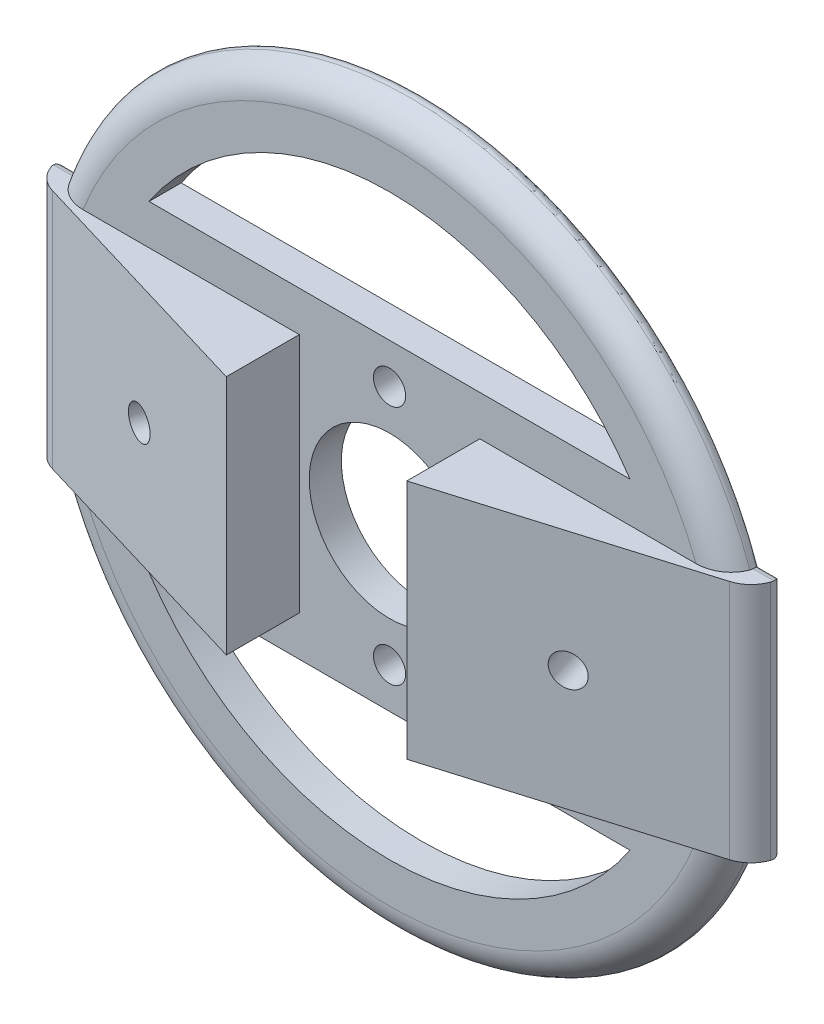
ISO-10303-21;
HEADER;
FILE_DESCRIPTION(('STEP AP214'),'2;1');
FILE_NAME('part.step','',(''),(''),'','','');
FILE_SCHEMA(('AUTOMOTIVE_DESIGN { 1 0 10303 214 1 1 1 1 }'));
ENDSEC;
DATA;
#1=APPLICATION_CONTEXT('core data for automotive mechanical design processes');
#2=APPLICATION_PROTOCOL_DEFINITION('international standard','automotive_design',2000,#1);
#3=PRODUCT_CONTEXT('',#1,'mechanical');
#4=PRODUCT('Part','Part','',(#3));
#5=PRODUCT_RELATED_PRODUCT_CATEGORY('part','',(#4));
#6=PRODUCT_DEFINITION_FORMATION('','',#4);
#7=PRODUCT_DEFINITION_CONTEXT('part definition',#1,'design');
#8=PRODUCT_DEFINITION('design','',#6,#7);
#9=PRODUCT_DEFINITION_SHAPE('','',#8);
#10=(LENGTH_UNIT() NAMED_UNIT(*) SI_UNIT(.MILLI.,.METRE.));
#11=(NAMED_UNIT(*) PLANE_ANGLE_UNIT() SI_UNIT($,.RADIAN.));
#12=(NAMED_UNIT(*) SI_UNIT($,.STERADIAN.) SOLID_ANGLE_UNIT());
#13=UNCERTAINTY_MEASURE_WITH_UNIT(LENGTH_MEASURE(1.E-05),#10,'distance_accuracy_value','');
#14=(GEOMETRIC_REPRESENTATION_CONTEXT(3) GLOBAL_UNCERTAINTY_ASSIGNED_CONTEXT((#13)) GLOBAL_UNIT_ASSIGNED_CONTEXT((#10,
#11,#12)) REPRESENTATION_CONTEXT('',''));
#15=CARTESIAN_POINT('',(0.,0.,0.));
#16=DIRECTION('',(0.,0.,1.));
#17=DIRECTION('',(1.,0.,0.));
#18=AXIS2_PLACEMENT_3D('',#15,#16,#17);
#19=CARTESIAN_POINT('',(0.,0.,0.));
#20=DIRECTION('',(0.,0.,1.));
#21=DIRECTION('',(1.,0.,0.));
#22=AXIS2_PLACEMENT_3D('',#19,#20,#21);
#23=PLANE('',#22);
#24=DIRECTION('',(1.,0.,0.));
#25=VECTOR('',#24,1.);
#26=CARTESIAN_POINT('',(0.,-14.,0.));
#27=LINE('',#26,#25);
#28=CARTESIAN_POINT('',(-41.5322889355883,-14.,0.));
#29=VERTEX_POINT('',#28);
#30=CARTESIAN_POINT('',(-43.8284271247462,-14.,0.));
#31=VERTEX_POINT('',#30);
#32=EDGE_CURVE('E421',#29,#31,#27,.F.);
#33=ORIENTED_EDGE('',*,*,#32,.T.);
#34=DIRECTION('',(0.,1.,0.));
#35=VECTOR('',#34,1.);
#36=CARTESIAN_POINT('',(-43.8284271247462,15.,0.));
#37=LINE('',#36,#35);
#38=CARTESIAN_POINT('',(-43.8284271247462,14.,0.));
#39=VERTEX_POINT('',#38);
#40=EDGE_CURVE('E423',#31,#39,#37,.T.);
#41=ORIENTED_EDGE('',*,*,#40,.T.);
#42=DIRECTION('',(1.,0.,0.));
#43=VECTOR('',#42,1.);
#44=CARTESIAN_POINT('',(-42.4264068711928,14.,0.));
#45=LINE('',#44,#43);
#46=CARTESIAN_POINT('',(-41.5322889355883,14.,0.));
#47=VERTEX_POINT('',#46);
#48=EDGE_CURVE('E411',#39,#47,#45,.T.);
#49=ORIENTED_EDGE('',*,*,#48,.T.);
#50=CARTESIAN_POINT('',(0.,0.,0.));
#51=DIRECTION('',(0.,0.,1.));
#52=DIRECTION('',(1.,0.,0.));
#53=AXIS2_PLACEMENT_3D('',#50,#51,#52);
#54=CIRCLE('',#53,43.8284271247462);
#55=CARTESIAN_POINT('',(41.5322889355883,14.,0.));
#56=VERTEX_POINT('',#55);
#57=EDGE_CURVE('E463',#47,#56,#54,.F.);
#58=ORIENTED_EDGE('',*,*,#57,.T.);
#59=DIRECTION('',(-1.,0.,0.));
#60=VECTOR('',#59,1.);
#61=CARTESIAN_POINT('',(45.,14.,0.));
#62=LINE('',#61,#60);
#63=CARTESIAN_POINT('',(43.8284271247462,14.,0.));
#64=VERTEX_POINT('',#63);
#65=EDGE_CURVE('E416',#56,#64,#62,.F.);
#66=ORIENTED_EDGE('',*,*,#65,.T.);
#67=DIRECTION('',(0.,-1.,0.));
#68=VECTOR('',#67,1.);
#69=CARTESIAN_POINT('',(43.8284271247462,0.,0.));
#70=LINE('',#69,#68);
#71=CARTESIAN_POINT('',(43.8284271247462,-14.,0.));
#72=VERTEX_POINT('',#71);
#73=EDGE_CURVE('E412',#64,#72,#70,.T.);
#74=ORIENTED_EDGE('',*,*,#73,.T.);
#75=DIRECTION('',(-1.,0.,0.));
#76=VECTOR('',#75,1.);
#77=CARTESIAN_POINT('',(0.,-14.,0.));
#78=LINE('',#77,#76);
#79=CARTESIAN_POINT('',(41.5322889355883,-14.,0.));
#80=VERTEX_POINT('',#79);
#81=EDGE_CURVE('E409',#72,#80,#78,.T.);
#82=ORIENTED_EDGE('',*,*,#81,.T.);
#83=CARTESIAN_POINT('',(0.,0.,0.));
#84=DIRECTION('',(0.,0.,1.));
#85=DIRECTION('',(1.,0.,0.));
#86=AXIS2_PLACEMENT_3D('',#83,#84,#85);
#87=CIRCLE('',#86,43.8284271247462);
#88=EDGE_CURVE('E407',#80,#29,#87,.F.);
#89=ORIENTED_EDGE('',*,*,#88,.T.);
#90=EDGE_LOOP('',(#33,#41,#49,#58,#66,#74,#82,#89));
#91=FACE_BOUND('',#90,.T.);
#92=CARTESIAN_POINT('',(0.,0.,0.));
#93=DIRECTION('',(0.,0.,1.));
#94=DIRECTION('',(1.,0.,0.));
#95=AXIS2_PLACEMENT_3D('',#92,#93,#94);
#96=CIRCLE('',#95,36.);
#97=CARTESIAN_POINT('',(-29.9332590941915,-20.,0.));
#98=VERTEX_POINT('',#97);
#99=CARTESIAN_POINT('',(29.9332590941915,-20.,0.));
#100=VERTEX_POINT('',#99);
#101=EDGE_CURVE('E213',#98,#100,#96,.T.);
#102=ORIENTED_EDGE('',*,*,#101,.T.);
#103=DIRECTION('',(-1.,0.,0.));
#104=VECTOR('',#103,1.);
#105=CARTESIAN_POINT('',(0.,-20.,0.));
#106=LINE('',#105,#104);
#107=EDGE_CURVE('E210',#100,#98,#106,.T.);
#108=ORIENTED_EDGE('',*,*,#107,.T.);
#109=EDGE_LOOP('',(#102,#108));
#110=FACE_BOUND('',#109,.T.);
#111=DIRECTION('',(1.,0.,0.));
#112=VECTOR('',#111,1.);
#113=CARTESIAN_POINT('',(0.,20.,0.));
#114=LINE('',#113,#112);
#115=CARTESIAN_POINT('',(-29.9332590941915,20.,0.));
#116=VERTEX_POINT('',#115);
#117=CARTESIAN_POINT('',(29.9332590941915,20.,0.));
#118=VERTEX_POINT('',#117);
#119=EDGE_CURVE('E236',#116,#118,#114,.T.);
#120=ORIENTED_EDGE('',*,*,#119,.T.);
#121=CARTESIAN_POINT('',(0.,0.,0.));
#122=DIRECTION('',(0.,0.,1.));
#123=DIRECTION('',(1.,0.,0.));
#124=AXIS2_PLACEMENT_3D('',#121,#122,#123);
#125=CIRCLE('',#124,36.);
#126=EDGE_CURVE('E241',#118,#116,#125,.T.);
#127=ORIENTED_EDGE('',*,*,#126,.T.);
#128=EDGE_LOOP('',(#120,#127));
#129=FACE_BOUND('',#128,.T.);
#130=CARTESIAN_POINT('',(0.,0.,0.));
#131=DIRECTION('',(0.,0.,1.));
#132=DIRECTION('',(1.,0.,0.));
#133=AXIS2_PLACEMENT_3D('',#130,#131,#132);
#134=CIRCLE('',#133,10.);
#135=CARTESIAN_POINT('',(10.,0.,0.));
#136=VERTEX_POINT('',#135);
#137=EDGE_CURVE('E247',#136,#136,#134,.T.);
#138=ORIENTED_EDGE('',*,*,#137,.T.);
#139=EDGE_LOOP('',(#138));
#140=FACE_BOUND('',#139,.T.);
#141=CARTESIAN_POINT('',(0.,-15.,0.));
#142=DIRECTION('',(0.,0.,1.));
#143=DIRECTION('',(1.,0.,0.));
#144=AXIS2_PLACEMENT_3D('',#141,#142,#143);
#145=CIRCLE('',#144,2.);
#146=CARTESIAN_POINT('',(2.,-15.,0.));
#147=VERTEX_POINT('',#146);
#148=EDGE_CURVE('E325',#147,#147,#145,.T.);
#149=ORIENTED_EDGE('',*,*,#148,.T.);
#150=EDGE_LOOP('',(#149));
#151=FACE_BOUND('',#150,.T.);
#152=CARTESIAN_POINT('',(0.,15.,0.));
#153=DIRECTION('',(0.,0.,1.));
#154=DIRECTION('',(1.,0.,0.));
#155=AXIS2_PLACEMENT_3D('',#152,#153,#154);
#156=CIRCLE('',#155,2.);
#157=CARTESIAN_POINT('',(2.,15.,0.));
#158=VERTEX_POINT('',#157);
#159=EDGE_CURVE('E319',#158,#158,#156,.T.);
#160=ORIENTED_EDGE('',*,*,#159,.T.);
#161=EDGE_LOOP('',(#160));
#162=FACE_BOUND('',#161,.T.);
#163=CARTESIAN_POINT('',(24.1588472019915,0.,0.));
#164=DIRECTION('',(0.,0.,1.));
#165=DIRECTION('',(1.,0.,0.));
#166=AXIS2_PLACEMENT_3D('',#163,#164,#165);
#167=ELLIPSE('',#166,2.08763923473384,2.);
#168=CARTESIAN_POINT('',(26.2464864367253,0.,0.));
#169=VERTEX_POINT('',#168);
#170=EDGE_CURVE('E287',#169,#169,#167,.T.);
#171=ORIENTED_EDGE('',*,*,#170,.T.);
#172=EDGE_LOOP('',(#171));
#173=FACE_BOUND('',#172,.T.);
#174=CARTESIAN_POINT('',(-24.1588472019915,0.,0.));
#175=DIRECTION('',(0.,0.,1.));
#176=DIRECTION('',(-1.,0.,0.));
#177=AXIS2_PLACEMENT_3D('',#174,#175,#176);
#178=ELLIPSE('',#177,2.08763923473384,2.);
#179=CARTESIAN_POINT('',(-26.2464864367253,0.,0.));
#180=VERTEX_POINT('',#179);
#181=EDGE_CURVE('E253',#180,#180,#178,.F.);
#182=ORIENTED_EDGE('',*,*,#181,.F.);
#183=EDGE_LOOP('',(#182));
#184=FACE_BOUND('',#183,.T.);
#185=ADVANCED_FACE('F35',(#91,#110,#129,#140,#151,#162,#173,#184),#23,.F.);
#186=CARTESIAN_POINT('',(-42.1468064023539,15.,3.83207973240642));
#187=DIRECTION('',(-0.286701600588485,0.,0.958019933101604));
#188=DIRECTION('',(0.958019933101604,0.,0.286701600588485));
#189=AXIS2_PLACEMENT_3D('',#186,#187,#188);
#190=PLANE('',#189);
#191=DIRECTION('',(-0.958019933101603,0.,-0.286701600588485));
#192=VECTOR('',#191,1.);
#193=CARTESIAN_POINT('',(-42.1468064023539,-15.,3.83207973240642));
#194=LINE('',#193,#192);
#195=CARTESIAN_POINT('',(-11.2331124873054,-15.,13.0834587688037));
#196=VERTEX_POINT('',#195);
#197=CARTESIAN_POINT('',(-42.1468064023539,-15.,3.83207973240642));
#198=VERTEX_POINT('',#197);
#199=EDGE_CURVE('E269',#196,#198,#194,.T.);
#200=ORIENTED_EDGE('',*,*,#199,.F.);
#201=DIRECTION('',(0.,-1.,0.));
#202=VECTOR('',#201,1.);
#203=CARTESIAN_POINT('',(-11.2331124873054,15.,13.0834587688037));
#204=LINE('',#203,#202);
#205=CARTESIAN_POINT('',(-11.2331124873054,15.,13.0834587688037));
#206=VERTEX_POINT('',#205);
#207=EDGE_CURVE('E266',#206,#196,#204,.T.);
#208=ORIENTED_EDGE('',*,*,#207,.F.);
#209=DIRECTION('',(-0.958019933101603,0.,-0.286701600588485));
#210=VECTOR('',#209,1.);
#211=CARTESIAN_POINT('',(-42.1468064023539,15.,3.83207973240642));
#212=LINE('',#211,#210);
#213=CARTESIAN_POINT('',(-42.1468064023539,15.,3.83207973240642));
#214=VERTEX_POINT('',#213);
#215=EDGE_CURVE('E260',#206,#214,#212,.T.);
#216=ORIENTED_EDGE('',*,*,#215,.T.);
#217=DIRECTION('',(0.,-1.,0.));
#218=VECTOR('',#217,1.);
#219=CARTESIAN_POINT('',(-42.1468064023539,15.,3.83207973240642));
#220=LINE('',#219,#218);
#221=EDGE_CURVE('E275',#214,#198,#220,.T.);
#222=ORIENTED_EDGE('',*,*,#221,.T.);
#223=EDGE_LOOP('',(#200,#208,#216,#222));
#224=FACE_BOUND('',#223,.T.);
#225=CARTESIAN_POINT('',(-26.6899594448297,0.,8.45776925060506));
#226=DIRECTION('',(0.286701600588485,0.,-0.958019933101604));
#227=DIRECTION('',(-0.958019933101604,0.,-0.286701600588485));
#228=AXIS2_PLACEMENT_3D('',#225,#226,#227);
#229=CIRCLE('',#228,2.);
#230=CARTESIAN_POINT('',(-28.6059993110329,0.,7.88436604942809));
#231=VERTEX_POINT('',#230);
#232=EDGE_CURVE('E250',#231,#231,#229,.T.);
#233=ORIENTED_EDGE('',*,*,#232,.T.);
#234=EDGE_LOOP('',(#233));
#235=FACE_BOUND('',#234,.T.);
#236=ADVANCED_FACE('F527',(#224,#235),#190,.T.);
#237=CARTESIAN_POINT('',(0.,0.,0.));
#238=DIRECTION('',(0.,0.,1.));
#239=DIRECTION('',(1.,0.,0.));
#240=AXIS2_PLACEMENT_3D('',#237,#238,#239);
#241=TOROIDAL_SURFACE('',#240,41.,4.);
#242=CARTESIAN_POINT('',(-42.2352273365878,-15.,1.18706853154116));
#243=CARTESIAN_POINT('',(-42.301843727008,-15.,0.985028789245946));
#244=CARTESIAN_POINT('',(-42.3516249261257,-15.,0.777282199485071));
#245=CARTESIAN_POINT('',(-42.4155764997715,-15.,0.356239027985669));
#246=CARTESIAN_POINT('',(-42.4297147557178,-15.,0.142937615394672));
#247=CARTESIAN_POINT('',(-42.4217993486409,-15.,-0.282949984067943));
#248=CARTESIAN_POINT('',(-42.3997554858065,-15.,-0.495536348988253));
#249=CARTESIAN_POINT('',(-42.3203133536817,-15.,-0.913936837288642));
#250=CARTESIAN_POINT('',(-42.262920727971,-15.,-1.11975203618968));
#251=CARTESIAN_POINT('',(-42.1147605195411,-15.,-1.51929413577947));
#252=CARTESIAN_POINT('',(-42.0239459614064,-15.,-1.71300357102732));
#253=CARTESIAN_POINT('',(-41.8120708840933,-15.,-2.08307854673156));
#254=CARTESIAN_POINT('',(-41.6910064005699,-15.,-2.259441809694));
#255=CARTESIAN_POINT('',(-41.4180947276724,-15.,-2.59615823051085));
#256=CARTESIAN_POINT('',(-41.2653708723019,-15.,-2.75579984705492));
#257=CARTESIAN_POINT('',(-40.9365292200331,-15.,-3.04878921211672));
#258=CARTESIAN_POINT('',(-40.7604061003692,-15.,-3.18213096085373));
#259=CARTESIAN_POINT('',(-40.3795574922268,-15.,-3.42657247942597));
#260=CARTESIAN_POINT('',(-40.1737936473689,-15.,-3.53605354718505));
#261=CARTESIAN_POINT('',(-39.7475804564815,-15.,-3.72116366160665));
#262=CARTESIAN_POINT('',(-39.5271270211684,-15.,-3.79678323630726));
#263=CARTESIAN_POINT('',(-39.0636006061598,-15.,-3.9166790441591));
#264=CARTESIAN_POINT('',(-38.8199657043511,-15.,-3.95878577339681));
#265=CARTESIAN_POINT('',(-38.3290890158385,-15.,-4.00342421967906));
#266=CARTESIAN_POINT('',(-38.0818462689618,-15.,-4.0059452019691));
#267=CARTESIAN_POINT('',(-37.5790777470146,-15.,-3.97088520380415));
#268=CARTESIAN_POINT('',(-37.3236749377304,-15.,-3.93150895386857));
#269=CARTESIAN_POINT('',(-36.8229810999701,-15.,-3.81077482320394));
#270=CARTESIAN_POINT('',(-36.5776916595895,-15.,-3.72941037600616));
#271=CARTESIAN_POINT('',(-36.1028769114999,-15.,-3.52552029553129));
#272=CARTESIAN_POINT('',(-35.8734532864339,-15.,-3.40275435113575));
#273=CARTESIAN_POINT('',(-35.5483937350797,-15.,-3.18992355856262));
#274=CARTESIAN_POINT('',(-35.4431679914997,-15.,-3.11415076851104));
#275=CARTESIAN_POINT('',(-35.2399967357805,-15.,-2.95343200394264));
#276=CARTESIAN_POINT('',(-35.1420476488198,-15.,-2.8684905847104));
#277=CARTESIAN_POINT('',(-34.9586914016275,-15.,-2.69400755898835));
#278=CARTESIAN_POINT('',(-34.8729159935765,-15.,-2.60485237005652));
#279=CARTESIAN_POINT('',(-34.7097805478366,-15.,-2.41921413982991));
#280=CARTESIAN_POINT('',(-34.6324162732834,-15.,-2.32273482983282));
#281=CARTESIAN_POINT('',(-34.4869073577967,-15.,-2.12304992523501));
#282=CARTESIAN_POINT('',(-34.4187627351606,-15.,-2.01984431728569));
#283=CARTESIAN_POINT('',(-34.2925392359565,-15.,-1.80751277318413));
#284=CARTESIAN_POINT('',(-34.2344549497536,-15.,-1.69839006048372));
#285=CARTESIAN_POINT('',(-34.1334001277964,-15.,-1.48425335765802));
#286=CARTESIAN_POINT('',(-34.0895792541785,-15.,-1.37964008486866));
#287=CARTESIAN_POINT('',(-34.0115369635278,-15.,-1.16694223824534));
#288=CARTESIAN_POINT('',(-33.9773108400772,-15.,-1.05885939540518));
#289=CARTESIAN_POINT('',(-33.9188584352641,-15.,-0.840045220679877));
#290=CARTESIAN_POINT('',(-33.8946299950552,-15.,-0.72931446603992));
#291=CARTESIAN_POINT('',(-33.8564735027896,-15.,-0.506092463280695));
#292=CARTESIAN_POINT('',(-33.8425449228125,-15.,-0.393601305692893));
#293=CARTESIAN_POINT('',(-33.825797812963,-15.,-0.175988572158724));
#294=CARTESIAN_POINT('',(-33.8222484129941,-15.,-0.0709226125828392));
#295=CARTESIAN_POINT('',(-33.8242080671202,-15.,0.13916182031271));
#296=CARTESIAN_POINT('',(-33.829720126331,-15.,0.244180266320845));
#297=CARTESIAN_POINT('',(-33.8497408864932,-15.,0.453300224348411));
#298=CARTESIAN_POINT('',(-33.8642449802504,-15.,0.557402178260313));
#299=CARTESIAN_POINT('',(-33.9020876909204,-15.,0.764024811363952));
#300=CARTESIAN_POINT('',(-33.9254295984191,-15.,0.866544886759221));
#301=CARTESIAN_POINT('',(-33.9801962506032,-15.,1.06741767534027));
#302=CARTESIAN_POINT('',(-34.01146753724,-15.,1.16581220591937));
#303=CARTESIAN_POINT('',(-34.0819611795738,-15.,1.35972261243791));
#304=CARTESIAN_POINT('',(-34.121186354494,-15.,1.45523745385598));
#305=CARTESIAN_POINT('',(-34.2502317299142,-15.,1.73650419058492));
#306=CARTESIAN_POINT('',(-34.3514701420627,-15.,1.91715342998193));
#307=CARTESIAN_POINT('',(-34.5855879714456,-15.,2.26776973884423));
#308=CARTESIAN_POINT('',(-34.7196350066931,-15.,2.43695001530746));
#309=CARTESIAN_POINT('',(-35.0123681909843,-15.,2.75245091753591));
#310=CARTESIAN_POINT('',(-35.1710619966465,-15.,2.89876441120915));
#311=CARTESIAN_POINT('',(-35.5215576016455,-15.,3.17630677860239));
#312=CARTESIAN_POINT('',(-35.714968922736,-15.,3.30550184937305));
#313=CARTESIAN_POINT('',(-36.1195241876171,-15.,3.53223689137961));
#314=CARTESIAN_POINT('',(-36.3306744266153,-15.,3.62976556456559));
#315=CARTESIAN_POINT('',(-36.7816011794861,-15.,3.79766479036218));
#316=CARTESIAN_POINT('',(-37.0223379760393,-15.,3.86546438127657));
#317=CARTESIAN_POINT('',(-37.5115688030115,-15.,3.96145393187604));
#318=CARTESIAN_POINT('',(-37.7600648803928,-15.,3.9896333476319));
#319=CARTESIAN_POINT('',(-38.2685211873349,-15.,4.00592749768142));
#320=CARTESIAN_POINT('',(-38.528542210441,-15.,3.99239365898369));
#321=CARTESIAN_POINT('',(-38.9138037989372,-15.,3.93930586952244));
#322=CARTESIAN_POINT('',(-39.041500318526,-15.,3.91612299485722));
#323=CARTESIAN_POINT('',(-39.2944176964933,-15.,3.85888538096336));
#324=CARTESIAN_POINT('',(-39.4196395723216,-15.,3.82483521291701));
#325=CARTESIAN_POINT('',(-39.6655710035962,-15.,3.74632131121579));
#326=CARTESIAN_POINT('',(-39.7863102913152,-15.,3.70195053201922));
#327=CARTESIAN_POINT('',(-40.0234048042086,-15.,3.60284552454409));
#328=CARTESIAN_POINT('',(-40.1397619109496,-15.,3.54811580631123));
#329=CARTESIAN_POINT('',(-40.3672247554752,-15.,3.42851207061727));
#330=CARTESIAN_POINT('',(-40.4783276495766,-15.,3.36363263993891));
#331=CARTESIAN_POINT('',(-40.6941763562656,-15.,3.22413567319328));
#332=CARTESIAN_POINT('',(-40.7989251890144,-15.,3.1495228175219));
#333=CARTESIAN_POINT('',(-40.9962625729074,-15.,2.99480891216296));
#334=CARTESIAN_POINT('',(-41.0891937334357,-15.,2.91514476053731));
#335=CARTESIAN_POINT('',(-41.2675696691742,-15.,2.74790675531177));
#336=CARTESIAN_POINT('',(-41.3530179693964,-15.,2.66033666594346));
#337=CARTESIAN_POINT('',(-41.5155544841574,-15.,2.47795038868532));
#338=CARTESIAN_POINT('',(-41.5926534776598,-15.,2.38314381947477));
#339=CARTESIAN_POINT('',(-41.7378161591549,-15.,2.18690645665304));
#340=CARTESIAN_POINT('',(-41.8058830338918,-15.,2.08547801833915));
#341=CARTESIAN_POINT('',(-41.9447400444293,-15.,1.8561754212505));
#342=CARTESIAN_POINT('',(-42.013435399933,-15.,1.72702200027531));
#343=CARTESIAN_POINT('',(-42.1358082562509,-15.,1.46183189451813));
#344=CARTESIAN_POINT('',(-42.1894863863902,-15.,1.32579549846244));
#345=CARTESIAN_POINT('',(-42.2352273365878,-15.,1.18706853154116));
#346=B_SPLINE_CURVE_WITH_KNOTS('',3,(#242,#243,#244,#245,#246,#247,#248,#249,#250,#251,#252,
#253,#254,#255,#256,#257,#258,#259,#260,#261,#262,#263,#264,#265,#266,#267,#268,#269,#270,#271,
#272,#273,#274,#275,#276,#277,#278,#279,#280,#281,#282,#283,#284,#285,#286,#287,#288,#289,#290,
#291,#292,#293,#294,#295,#296,#297,#298,#299,#300,#301,#302,#303,#304,#305,#306,#307,#308,#309,
#310,#311,#312,#313,#314,#315,#316,#317,#318,#319,#320,#321,#322,#323,#324,#325,#326,#327,#328,
#329,#330,#331,#332,#333,#334,#335,#336,#337,#338,#339,#340,#341,#342,#343,#344,#345),
.UNSPECIFIED.,.T.,.F.,(4,2,2,2,2,2,2,2,2,2,2,2,2,2,2,2,2,2,2,2,2,2,2,2,2,2,2,2,2,2,2,2,2,2,2,2,
2,2,2,2,2,2,2,2,2,2,2,2,2,2,2,4),(0.,0.637710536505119,1.27599552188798,1.91410765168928,
2.55211793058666,3.19102839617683,3.83002263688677,4.48989870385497,5.14992513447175,
5.84611046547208,6.54249041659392,7.28094021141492,8.01959025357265,8.79121535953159,
9.5629611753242,10.3392659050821,10.7278398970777,11.1162217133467,11.4868925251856,
11.8573757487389,12.2278597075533,12.5981438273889,12.9379603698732,13.2776099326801,
13.6171861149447,13.9567448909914,14.2717378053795,14.5868352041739,14.9017712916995,
15.2168247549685,15.5261929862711,15.8356710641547,16.4540885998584,17.0989430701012,
17.7439982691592,18.4388048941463,19.1338591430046,19.8808011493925,20.6279418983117,
21.404984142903,21.7939461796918,22.1827448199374,22.5681687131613,22.9534251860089,
23.3388878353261,23.7241658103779,24.0909030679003,24.4574666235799,24.8235511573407,
25.1895061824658,25.6273970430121,26.0652695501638),.UNSPECIFIED.);
#347=CARTESIAN_POINT('',(-38.1575680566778,-15.,4.));
#348=VERTEX_POINT('',#347);
#349=CARTESIAN_POINT('',(-42.1836886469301,-15.,1.33333333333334));
#350=VERTEX_POINT('',#349);
#351=EDGE_CURVE('E464',#348,#350,#346,.T.);
#352=ORIENTED_EDGE('',*,*,#351,.T.);
#353=CARTESIAN_POINT('',(0.,0.,1.33333333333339));
#354=DIRECTION('',(0.,0.,-1.));
#355=DIRECTION('',(-1.,0.,0.));
#356=AXIS2_PLACEMENT_3D('',#353,#354,#355);
#357=CIRCLE('',#356,44.7712361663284);
#358=CARTESIAN_POINT('',(42.1836886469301,-15.,1.33333333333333));
#359=VERTEX_POINT('',#358);
#360=EDGE_CURVE('E443',#350,#359,#357,.F.);
#361=ORIENTED_EDGE('',*,*,#360,.T.);
#362=CARTESIAN_POINT('',(34.1896446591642,-15.,1.6033334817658));
#363=CARTESIAN_POINT('',(34.0998114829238,-15.,1.41528664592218));
#364=CARTESIAN_POINT('',(34.0252539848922,-15.,1.21982490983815));
#365=CARTESIAN_POINT('',(33.9097863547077,-15.,0.819101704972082));
#366=CARTESIAN_POINT('',(33.8688906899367,-15.,0.613836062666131));
#367=CARTESIAN_POINT('',(33.8225496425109,-15.,0.199134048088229));
#368=CARTESIAN_POINT('',(33.8171343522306,-15.,-0.0103057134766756));
#369=CARTESIAN_POINT('',(33.8420887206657,-15.,-0.427007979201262));
#370=CARTESIAN_POINT('',(33.872454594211,-15.,-0.634270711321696));
#371=CARTESIAN_POINT('',(33.9670033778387,-15.,-1.03813998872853));
#372=CARTESIAN_POINT('',(34.0307573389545,-15.,-1.23484758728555));
#373=CARTESIAN_POINT('',(34.1892320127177,-15.,-1.61532865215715));
#374=CARTESIAN_POINT('',(34.2839570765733,-15.,-1.79910029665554));
#375=CARTESIAN_POINT('',(34.5049620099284,-15.,-2.15604440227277));
#376=CARTESIAN_POINT('',(34.632281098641,-15.,-2.3285717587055));
#377=CARTESIAN_POINT('',(34.9121955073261,-15.,-2.651692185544));
#378=CARTESIAN_POINT('',(35.0647983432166,-15.,-2.80227870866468));
#379=CARTESIAN_POINT('',(35.4030793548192,-15.,-3.08928224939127));
#380=CARTESIAN_POINT('',(35.5903810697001,-15.,-3.22378487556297));
#381=CARTESIAN_POINT('',(35.9835844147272,-15.,-3.46207807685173));
#382=CARTESIAN_POINT('',(36.1894926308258,-15.,-3.56585772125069));
#383=CARTESIAN_POINT('',(36.6309661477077,-15.,-3.74779838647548));
#384=CARTESIAN_POINT('',(36.8675948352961,-15.,-3.82338444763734));
#385=CARTESIAN_POINT('',(37.3499203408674,-15.,-3.93569233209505));
#386=CARTESIAN_POINT('',(37.5956197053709,-15.,-3.9724031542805));
#387=CARTESIAN_POINT('',(38.1008691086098,-15.,-4.00688062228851));
#388=CARTESIAN_POINT('',(38.3605458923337,-15.,-4.00282560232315));
#389=CARTESIAN_POINT('',(38.8755550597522,-15.,-3.95105246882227));
#390=CARTESIAN_POINT('',(39.1308871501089,-15.,-3.90333141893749));
#391=CARTESIAN_POINT('',(39.6286864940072,-15.,-3.7649733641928));
#392=CARTESIAN_POINT('',(39.8711980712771,-15.,-3.67449666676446));
#393=CARTESIAN_POINT('',(40.3365258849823,-15.,-3.45220848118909));
#394=CARTESIAN_POINT('',(40.5593466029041,-15.,-3.32040642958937));
#395=CARTESIAN_POINT('',(40.9677290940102,-15.,-3.02532029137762));
#396=CARTESIAN_POINT('',(41.154529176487,-15.,-2.86375261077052));
#397=CARTESIAN_POINT('',(41.4960447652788,-15.,-2.50964150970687));
#398=CARTESIAN_POINT('',(41.6507733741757,-15.,-2.31711079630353));
#399=CARTESIAN_POINT('',(41.9132380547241,-15.,-1.9197731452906));
#400=CARTESIAN_POINT('',(42.023338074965,-15.,-1.7165272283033));
#401=CARTESIAN_POINT('',(42.2056132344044,-15.,-1.293686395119));
#402=CARTESIAN_POINT('',(42.2778021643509,-15.,-1.07409745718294));
#403=CARTESIAN_POINT('',(42.3785031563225,-15.,-0.637559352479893));
#404=CARTESIAN_POINT('',(42.4091517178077,-15.,-0.421101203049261));
#405=CARTESIAN_POINT('',(42.4326597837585,-15.,0.0138427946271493));
#406=CARTESIAN_POINT('',(42.4255262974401,-15.,0.232328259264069));
#407=CARTESIAN_POINT('',(42.3744026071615,-15.,0.659455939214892));
#408=CARTESIAN_POINT('',(42.3313228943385,-15.,0.868208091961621));
#409=CARTESIAN_POINT('',(42.2110753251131,-15.,1.27562719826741));
#410=CARTESIAN_POINT('',(42.1339072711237,-15.,1.4742940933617));
#411=CARTESIAN_POINT('',(41.9472023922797,-15.,1.85832803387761));
#412=CARTESIAN_POINT('',(41.8373351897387,-15.,2.04353408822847));
#413=CARTESIAN_POINT('',(41.5892124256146,-15.,2.39380379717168));
#414=CARTESIAN_POINT('',(41.450952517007,-15.,2.5588643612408));
#415=CARTESIAN_POINT('',(41.1441696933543,-15.,2.87147191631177));
#416=CARTESIAN_POINT('',(40.9746457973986,-15.,3.0180354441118));
#417=CARTESIAN_POINT('',(40.6145647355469,-15.,3.28248463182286));
#418=CARTESIAN_POINT('',(40.4240023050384,-15.,3.40036308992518));
#419=CARTESIAN_POINT('',(40.0154347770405,-15.,3.6114176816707));
#420=CARTESIAN_POINT('',(39.79647692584,-15.,3.7027489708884));
#421=CARTESIAN_POINT('',(39.3468813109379,-15.,3.84963204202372));
#422=CARTESIAN_POINT('',(39.1162402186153,-15.,3.90517356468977));
#423=CARTESIAN_POINT('',(38.6355345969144,-15.,3.98203466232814));
#424=CARTESIAN_POINT('',(38.3851206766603,-15.,4.00117539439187));
#425=CARTESIAN_POINT('',(37.8844715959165,-15.,3.99871232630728));
#426=CARTESIAN_POINT('',(37.6342364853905,-15.,3.9770997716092));
#427=CARTESIAN_POINT('',(37.1318017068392,-15.,3.89229072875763));
#428=CARTESIAN_POINT('',(36.8798451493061,-15.,3.82765161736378));
#429=CARTESIAN_POINT('',(36.3902495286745,-15.,3.65654310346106));
#430=CARTESIAN_POINT('',(36.1526153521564,-15.,3.55005951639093));
#431=CARTESIAN_POINT('',(35.8138812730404,-15.,3.36127592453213));
#432=CARTESIAN_POINT('',(35.7042952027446,-15.,3.2938070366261));
#433=CARTESIAN_POINT('',(35.491504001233,-15.,3.14949112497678));
#434=CARTESIAN_POINT('',(35.3882960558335,-15.,3.07264828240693));
#435=CARTESIAN_POINT('',(35.1893206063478,-15.,2.91008426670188));
#436=CARTESIAN_POINT('',(35.0935447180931,-15.,2.82437336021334));
#437=CARTESIAN_POINT('',(34.9103000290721,-15.,2.64455460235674));
#438=CARTESIAN_POINT('',(34.8228284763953,-15.,2.55044955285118));
#439=CARTESIAN_POINT('',(34.6308044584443,-15.,2.32328040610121));
#440=CARTESIAN_POINT('',(34.5296322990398,-15.,2.18732552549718));
#441=CARTESIAN_POINT('',(34.3455038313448,-15.,1.90365125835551));
#442=CARTESIAN_POINT('',(34.2625444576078,-15.,1.75593385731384));
#443=CARTESIAN_POINT('',(34.1896446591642,-15.,1.6033334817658));
#444=B_SPLINE_CURVE_WITH_KNOTS('',3,(#362,#363,#364,#365,#366,#367,#368,#369,#370,#371,#372,
#373,#374,#375,#376,#377,#378,#379,#380,#381,#382,#383,#384,#385,#386,#387,#388,#389,#390,#391,
#392,#393,#394,#395,#396,#397,#398,#399,#400,#401,#402,#403,#404,#405,#406,#407,#408,#409,#410,
#411,#412,#413,#414,#415,#416,#417,#418,#419,#420,#421,#422,#423,#424,#425,#426,#427,#428,#429,
#430,#431,#432,#433,#434,#435,#436,#437,#438,#439,#440,#441,#442,#443),.UNSPECIFIED.,.T.,.F.,(4,
2,2,2,2,2,2,2,2,2,2,2,2,2,2,2,2,2,2,2,2,2,2,2,2,2,2,2,2,2,2,2,2,2,2,2,2,2,2,2,4),(0.,
0.624650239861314,1.24956880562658,1.87501732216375,2.50039968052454,3.11793778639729,
3.73556268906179,4.3760741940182,5.01677644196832,5.70561200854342,6.39469235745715,
7.13661665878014,7.87875085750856,8.65419041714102,9.42968212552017,10.2022890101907,
10.9747196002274,11.7118073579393,12.4485933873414,13.1384902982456,13.8281360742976,
14.4807628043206,15.1332684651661,15.7697312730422,16.4061977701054,17.0493267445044,
17.692554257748,18.3619037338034,19.0314210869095,19.7400416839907,20.4488653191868,
21.1989249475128,21.9491457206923,22.7258800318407,23.5028778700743,23.8885388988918,
24.2740285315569,24.6590767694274,25.0439969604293,25.5509872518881,26.0578921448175),.UNSPECIFIED.);
#445=CARTESIAN_POINT('',(38.1575680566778,-15.,4.));
#446=VERTEX_POINT('',#445);
#447=EDGE_CURVE('E334',#359,#446,#444,.T.);
#448=ORIENTED_EDGE('',*,*,#447,.T.);
#449=CARTESIAN_POINT('',(0.,0.,4.));
#450=DIRECTION('',(0.,0.,1.));
#451=DIRECTION('',(1.,0.,0.));
#452=AXIS2_PLACEMENT_3D('',#449,#450,#451);
#453=CIRCLE('',#452,41.);
#454=EDGE_CURVE('E328',#348,#446,#453,.T.);
#455=ORIENTED_EDGE('',*,*,#454,.F.);
#456=EDGE_LOOP('',(#352,#361,#448,#455));
#457=FACE_BOUND('',#456,.T.);
#458=ADVANCED_FACE('F533',(#457),#241,.T.);
#459=CARTESIAN_POINT('',(0.,0.,4.));
#460=DIRECTION('',(0.,0.,1.));
#461=DIRECTION('',(1.,0.,0.));
#462=AXIS2_PLACEMENT_3D('',#459,#460,#461);
#463=PLANE('',#462);
#464=DIRECTION('',(-1.,0.,0.));
#465=VECTOR('',#464,1.);
#466=CARTESIAN_POINT('',(-6.23311248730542,-20.,4.));
#467=LINE('',#466,#465);
#468=CARTESIAN_POINT('',(29.9332590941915,-20.,4.));
#469=VERTEX_POINT('',#468);
#470=CARTESIAN_POINT('',(-29.9332590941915,-20.,4.));
#471=VERTEX_POINT('',#470);
#472=EDGE_CURVE('E207',#469,#471,#467,.T.);
#473=ORIENTED_EDGE('',*,*,#472,.F.);
#474=CARTESIAN_POINT('',(0.,0.,4.));
#475=DIRECTION('',(0.,0.,1.));
#476=DIRECTION('',(1.,0.,0.));
#477=AXIS2_PLACEMENT_3D('',#474,#475,#476);
#478=CIRCLE('',#477,36.);
#479=EDGE_CURVE('E217',#471,#469,#478,.T.);
#480=ORIENTED_EDGE('',*,*,#479,.F.);
#481=EDGE_LOOP('',(#473,#480));
#482=FACE_BOUND('',#481,.T.);
#483=CARTESIAN_POINT('',(0.,0.,4.));
#484=DIRECTION('',(0.,0.,1.));
#485=DIRECTION('',(1.,0.,0.));
#486=AXIS2_PLACEMENT_3D('',#483,#484,#485);
#487=CIRCLE('',#486,36.);
#488=CARTESIAN_POINT('',(29.9332590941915,20.,4.));
#489=VERTEX_POINT('',#488);
#490=CARTESIAN_POINT('',(-29.9332590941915,20.,4.));
#491=VERTEX_POINT('',#490);
#492=EDGE_CURVE('E228',#489,#491,#487,.T.);
#493=ORIENTED_EDGE('',*,*,#492,.F.);
#494=DIRECTION('',(1.,0.,0.));
#495=VECTOR('',#494,1.);
#496=CARTESIAN_POINT('',(6.23311248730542,20.,4.));
#497=LINE('',#496,#495);
#498=EDGE_CURVE('E230',#491,#489,#497,.T.);
#499=ORIENTED_EDGE('',*,*,#498,.F.);
#500=EDGE_LOOP('',(#493,#499));
#501=FACE_BOUND('',#500,.T.);
#502=CARTESIAN_POINT('',(0.,0.,4.));
#503=DIRECTION('',(0.,0.,1.));
#504=DIRECTION('',(1.,0.,0.));
#505=AXIS2_PLACEMENT_3D('',#502,#503,#504);
#506=CIRCLE('',#505,10.);
#507=CARTESIAN_POINT('',(10.,0.,4.));
#508=VERTEX_POINT('',#507);
#509=EDGE_CURVE('E244',#508,#508,#506,.T.);
#510=ORIENTED_EDGE('',*,*,#509,.F.);
#511=EDGE_LOOP('',(#510));
#512=FACE_BOUND('',#511,.T.);
#513=DIRECTION('',(-1.,0.,0.));
#514=VECTOR('',#513,1.);
#515=CARTESIAN_POINT('',(0.,15.,4.));
#516=LINE('',#515,#514);
#517=CARTESIAN_POINT('',(-11.2331124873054,15.,4.));
#518=VERTEX_POINT('',#517);
#519=CARTESIAN_POINT('',(-38.1575680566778,15.,4.));
#520=VERTEX_POINT('',#519);
#521=EDGE_CURVE('E280',#518,#520,#516,.T.);
#522=ORIENTED_EDGE('',*,*,#521,.F.);
#523=DIRECTION('',(0.,1.,0.));
#524=VECTOR('',#523,1.);
#525=CARTESIAN_POINT('',(-11.2331124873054,0.,4.));
#526=LINE('',#525,#524);
#527=CARTESIAN_POINT('',(-11.2331124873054,-15.,4.));
#528=VERTEX_POINT('',#527);
#529=EDGE_CURVE('E282',#528,#518,#526,.T.);
#530=ORIENTED_EDGE('',*,*,#529,.F.);
#531=DIRECTION('',(-1.,0.,0.));
#532=VECTOR('',#531,1.);
#533=CARTESIAN_POINT('',(0.,-15.,4.));
#534=LINE('',#533,#532);
#535=EDGE_CURVE('E277',#528,#348,#534,.T.);
#536=ORIENTED_EDGE('',*,*,#535,.T.);
#537=ORIENTED_EDGE('',*,*,#454,.T.);
#538=DIRECTION('',(-1.,0.,0.));
#539=VECTOR('',#538,1.);
#540=CARTESIAN_POINT('',(0.,-15.,4.));
#541=LINE('',#540,#539);
#542=CARTESIAN_POINT('',(11.2331124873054,-15.,4.));
#543=VERTEX_POINT('',#542);
#544=EDGE_CURVE('E310',#446,#543,#541,.T.);
#545=ORIENTED_EDGE('',*,*,#544,.T.);
#546=DIRECTION('',(0.,1.,0.));
#547=VECTOR('',#546,1.);
#548=CARTESIAN_POINT('',(11.2331124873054,0.,4.));
#549=LINE('',#548,#547);
#550=CARTESIAN_POINT('',(11.2331124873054,15.,4.));
#551=VERTEX_POINT('',#550);
#552=EDGE_CURVE('E315',#543,#551,#549,.T.);
#553=ORIENTED_EDGE('',*,*,#552,.T.);
#554=DIRECTION('',(-1.,0.,0.));
#555=VECTOR('',#554,1.);
#556=CARTESIAN_POINT('',(0.,15.,4.));
#557=LINE('',#556,#555);
#558=CARTESIAN_POINT('',(38.1575680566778,15.,4.));
#559=VERTEX_POINT('',#558);
#560=EDGE_CURVE('E313',#559,#551,#557,.T.);
#561=ORIENTED_EDGE('',*,*,#560,.F.);
#562=EDGE_CURVE('E331',#559,#520,#453,.T.);
#563=ORIENTED_EDGE('',*,*,#562,.T.);
#564=EDGE_LOOP('',(#522,#530,#536,#537,#545,#553,#561,#563));
#565=FACE_BOUND('',#564,.T.);
#566=CARTESIAN_POINT('',(0.,15.,4.));
#567=DIRECTION('',(0.,0.,1.));
#568=DIRECTION('',(1.,0.,0.));
#569=AXIS2_PLACEMENT_3D('',#566,#567,#568);
#570=CIRCLE('',#569,2.);
#571=CARTESIAN_POINT('',(2.,15.,4.));
#572=VERTEX_POINT('',#571);
#573=EDGE_CURVE('E318',#572,#572,#570,.T.);
#574=ORIENTED_EDGE('',*,*,#573,.F.);
#575=EDGE_LOOP('',(#574));
#576=FACE_BOUND('',#575,.T.);
#577=CARTESIAN_POINT('',(0.,-15.,4.));
#578=DIRECTION('',(0.,0.,1.));
#579=DIRECTION('',(1.,0.,0.));
#580=AXIS2_PLACEMENT_3D('',#577,#578,#579);
#581=CIRCLE('',#580,2.);
#582=CARTESIAN_POINT('',(2.,-15.,4.));
#583=VERTEX_POINT('',#582);
#584=EDGE_CURVE('E322',#583,#583,#581,.T.);
#585=ORIENTED_EDGE('',*,*,#584,.F.);
#586=EDGE_LOOP('',(#585));
#587=FACE_BOUND('',#586,.T.);
#588=ADVANCED_FACE('F221',(#482,#501,#512,#565,#576,#587),#463,.T.);
#589=CARTESIAN_POINT('',(34.1896446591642,15.,1.6033334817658));
#590=CARTESIAN_POINT('',(34.0998114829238,15.,1.41528664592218));
#591=CARTESIAN_POINT('',(34.0252539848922,15.,1.21982490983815));
#592=CARTESIAN_POINT('',(33.9097863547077,15.,0.819101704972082));
#593=CARTESIAN_POINT('',(33.8688906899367,15.,0.613836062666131));
#594=CARTESIAN_POINT('',(33.8225496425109,15.,0.199134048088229));
#595=CARTESIAN_POINT('',(33.8171343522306,15.,-0.0103057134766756));
#596=CARTESIAN_POINT('',(33.8420887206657,15.,-0.427007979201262));
#597=CARTESIAN_POINT('',(33.872454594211,15.,-0.634270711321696));
#598=CARTESIAN_POINT('',(33.9670033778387,15.,-1.03813998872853));
#599=CARTESIAN_POINT('',(34.0307573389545,15.,-1.23484758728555));
#600=CARTESIAN_POINT('',(34.1892320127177,15.,-1.61532865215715));
#601=CARTESIAN_POINT('',(34.2839570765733,15.,-1.79910029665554));
#602=CARTESIAN_POINT('',(34.5049620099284,15.,-2.15604440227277));
#603=CARTESIAN_POINT('',(34.632281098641,15.,-2.3285717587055));
#604=CARTESIAN_POINT('',(34.9121955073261,15.,-2.651692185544));
#605=CARTESIAN_POINT('',(35.0647983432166,15.,-2.80227870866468));
#606=CARTESIAN_POINT('',(35.4030793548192,15.,-3.08928224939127));
#607=CARTESIAN_POINT('',(35.5903810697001,15.,-3.22378487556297));
#608=CARTESIAN_POINT('',(35.9835844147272,15.,-3.46207807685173));
#609=CARTESIAN_POINT('',(36.1894926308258,15.,-3.56585772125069));
#610=CARTESIAN_POINT('',(36.6309661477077,15.,-3.74779838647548));
#611=CARTESIAN_POINT('',(36.8675948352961,15.,-3.82338444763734));
#612=CARTESIAN_POINT('',(37.3499203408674,15.,-3.93569233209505));
#613=CARTESIAN_POINT('',(37.5956197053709,15.,-3.9724031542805));
#614=CARTESIAN_POINT('',(38.1008691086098,15.,-4.00688062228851));
#615=CARTESIAN_POINT('',(38.3605458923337,15.,-4.00282560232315));
#616=CARTESIAN_POINT('',(38.8755550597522,15.,-3.95105246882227));
#617=CARTESIAN_POINT('',(39.1308871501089,15.,-3.90333141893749));
#618=CARTESIAN_POINT('',(39.6286864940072,15.,-3.7649733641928));
#619=CARTESIAN_POINT('',(39.8711980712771,15.,-3.67449666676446));
#620=CARTESIAN_POINT('',(40.3365258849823,15.,-3.45220848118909));
#621=CARTESIAN_POINT('',(40.5593466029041,15.,-3.32040642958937));
#622=CARTESIAN_POINT('',(40.9677290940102,15.,-3.02532029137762));
#623=CARTESIAN_POINT('',(41.154529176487,15.,-2.86375261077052));
#624=CARTESIAN_POINT('',(41.4960447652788,15.,-2.50964150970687));
#625=CARTESIAN_POINT('',(41.6507733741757,15.,-2.31711079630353));
#626=CARTESIAN_POINT('',(41.9132380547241,15.,-1.9197731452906));
#627=CARTESIAN_POINT('',(42.023338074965,15.,-1.7165272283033));
#628=CARTESIAN_POINT('',(42.2056132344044,15.,-1.293686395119));
#629=CARTESIAN_POINT('',(42.2778021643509,15.,-1.07409745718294));
#630=CARTESIAN_POINT('',(42.3785031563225,15.,-0.637559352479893));
#631=CARTESIAN_POINT('',(42.4091517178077,15.,-0.421101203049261));
#632=CARTESIAN_POINT('',(42.4326597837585,15.,0.0138427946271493));
#633=CARTESIAN_POINT('',(42.4255262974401,15.,0.232328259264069));
#634=CARTESIAN_POINT('',(42.3744026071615,15.,0.659455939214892));
#635=CARTESIAN_POINT('',(42.3313228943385,15.,0.868208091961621));
#636=CARTESIAN_POINT('',(42.2110753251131,15.,1.27562719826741));
#637=CARTESIAN_POINT('',(42.1339072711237,15.,1.4742940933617));
#638=CARTESIAN_POINT('',(41.9472023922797,15.,1.85832803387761));
#639=CARTESIAN_POINT('',(41.8373351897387,15.,2.04353408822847));
#640=CARTESIAN_POINT('',(41.5892124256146,15.,2.39380379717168));
#641=CARTESIAN_POINT('',(41.450952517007,15.,2.5588643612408));
#642=CARTESIAN_POINT('',(41.1441696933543,15.,2.87147191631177));
#643=CARTESIAN_POINT('',(40.9746457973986,15.,3.0180354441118));
#644=CARTESIAN_POINT('',(40.6145647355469,15.,3.28248463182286));
#645=CARTESIAN_POINT('',(40.4240023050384,15.,3.40036308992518));
#646=CARTESIAN_POINT('',(40.0154347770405,15.,3.6114176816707));
#647=CARTESIAN_POINT('',(39.79647692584,15.,3.7027489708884));
#648=CARTESIAN_POINT('',(39.3468813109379,15.,3.84963204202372));
#649=CARTESIAN_POINT('',(39.1162402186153,15.,3.90517356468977));
#650=CARTESIAN_POINT('',(38.6355345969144,15.,3.98203466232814));
#651=CARTESIAN_POINT('',(38.3851206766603,15.,4.00117539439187));
#652=CARTESIAN_POINT('',(37.8844715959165,15.,3.99871232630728));
#653=CARTESIAN_POINT('',(37.6342364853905,15.,3.9770997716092));
#654=CARTESIAN_POINT('',(37.1318017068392,15.,3.89229072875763));
#655=CARTESIAN_POINT('',(36.8798451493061,15.,3.82765161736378));
#656=CARTESIAN_POINT('',(36.3902495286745,15.,3.65654310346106));
#657=CARTESIAN_POINT('',(36.1526153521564,15.,3.55005951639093));
#658=CARTESIAN_POINT('',(35.8138812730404,15.,3.36127592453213));
#659=CARTESIAN_POINT('',(35.7042952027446,15.,3.2938070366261));
#660=CARTESIAN_POINT('',(35.491504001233,15.,3.14949112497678));
#661=CARTESIAN_POINT('',(35.3882960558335,15.,3.07264828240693));
#662=CARTESIAN_POINT('',(35.1893206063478,15.,2.91008426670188));
#663=CARTESIAN_POINT('',(35.0935447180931,15.,2.82437336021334));
#664=CARTESIAN_POINT('',(34.9103000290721,15.,2.64455460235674));
#665=CARTESIAN_POINT('',(34.8228284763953,15.,2.55044955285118));
#666=CARTESIAN_POINT('',(34.6308044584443,15.,2.32328040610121));
#667=CARTESIAN_POINT('',(34.5296322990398,15.,2.18732552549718));
#668=CARTESIAN_POINT('',(34.3455038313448,15.,1.90365125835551));
#669=CARTESIAN_POINT('',(34.2625444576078,15.,1.75593385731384));
#670=CARTESIAN_POINT('',(34.1896446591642,15.,1.6033334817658));
#671=B_SPLINE_CURVE_WITH_KNOTS('',3,(#589,#590,#591,#592,#593,#594,#595,#596,#597,#598,#599,
#600,#601,#602,#603,#604,#605,#606,#607,#608,#609,#610,#611,#612,#613,#614,#615,#616,#617,#618,
#619,#620,#621,#622,#623,#624,#625,#626,#627,#628,#629,#630,#631,#632,#633,#634,#635,#636,#637,
#638,#639,#640,#641,#642,#643,#644,#645,#646,#647,#648,#649,#650,#651,#652,#653,#654,#655,#656,
#657,#658,#659,#660,#661,#662,#663,#664,#665,#666,#667,#668,#669,#670),.UNSPECIFIED.,.T.,.F.,(4,
2,2,2,2,2,2,2,2,2,2,2,2,2,2,2,2,2,2,2,2,2,2,2,2,2,2,2,2,2,2,2,2,2,2,2,2,2,2,2,4),(0.,
0.624650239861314,1.24956880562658,1.87501732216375,2.50039968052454,3.11793778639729,
3.73556268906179,4.3760741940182,5.01677644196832,5.70561200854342,6.39469235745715,
7.13661665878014,7.87875085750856,8.65419041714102,9.42968212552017,10.2022890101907,
10.9747196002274,11.7118073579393,12.4485933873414,13.1384902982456,13.8281360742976,
14.4807628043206,15.1332684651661,15.7697312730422,16.4061977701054,17.0493267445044,
17.692554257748,18.3619037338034,19.0314210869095,19.7400416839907,20.4488653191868,
21.1989249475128,21.9491457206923,22.7258800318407,23.5028778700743,23.8885388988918,
24.2740285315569,24.6590767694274,25.0439969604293,25.5509872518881,26.0578921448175),.UNSPECIFIED.);
#672=CARTESIAN_POINT('',(42.1836886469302,15.,1.33333333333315));
#673=VERTEX_POINT('',#672);
#674=EDGE_CURVE('E340',#673,#559,#671,.T.);
#675=ORIENTED_EDGE('',*,*,#674,.F.);
#676=CARTESIAN_POINT('',(0.,0.,1.33333333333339));
#677=DIRECTION('',(0.,0.,-1.));
#678=DIRECTION('',(-1.,0.,0.));
#679=AXIS2_PLACEMENT_3D('',#676,#677,#678);
#680=CIRCLE('',#679,44.7712361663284);
#681=CARTESIAN_POINT('',(-42.1836886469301,15.,1.33333333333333));
#682=VERTEX_POINT('',#681);
#683=EDGE_CURVE('E369',#673,#682,#680,.F.);
#684=ORIENTED_EDGE('',*,*,#683,.T.);
#685=CARTESIAN_POINT('',(-42.2352273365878,15.,1.18706853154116));
#686=CARTESIAN_POINT('',(-42.301843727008,15.,0.985028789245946));
#687=CARTESIAN_POINT('',(-42.3516249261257,15.,0.777282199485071));
#688=CARTESIAN_POINT('',(-42.4155764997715,15.,0.356239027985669));
#689=CARTESIAN_POINT('',(-42.4297147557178,15.,0.142937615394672));
#690=CARTESIAN_POINT('',(-42.4217993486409,15.,-0.282949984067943));
#691=CARTESIAN_POINT('',(-42.3997554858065,15.,-0.495536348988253));
#692=CARTESIAN_POINT('',(-42.3203133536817,15.,-0.913936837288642));
#693=CARTESIAN_POINT('',(-42.262920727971,15.,-1.11975203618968));
#694=CARTESIAN_POINT('',(-42.1147605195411,15.,-1.51929413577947));
#695=CARTESIAN_POINT('',(-42.0239459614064,15.,-1.71300357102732));
#696=CARTESIAN_POINT('',(-41.8120708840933,15.,-2.08307854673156));
#697=CARTESIAN_POINT('',(-41.6910064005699,15.,-2.259441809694));
#698=CARTESIAN_POINT('',(-41.4180947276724,15.,-2.59615823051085));
#699=CARTESIAN_POINT('',(-41.2653708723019,15.,-2.75579984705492));
#700=CARTESIAN_POINT('',(-40.9365292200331,15.,-3.04878921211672));
#701=CARTESIAN_POINT('',(-40.7604061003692,15.,-3.18213096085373));
#702=CARTESIAN_POINT('',(-40.3795574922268,15.,-3.42657247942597));
#703=CARTESIAN_POINT('',(-40.1737936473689,15.,-3.53605354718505));
#704=CARTESIAN_POINT('',(-39.7475804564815,15.,-3.72116366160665));
#705=CARTESIAN_POINT('',(-39.5271270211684,15.,-3.79678323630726));
#706=CARTESIAN_POINT('',(-39.0636006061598,15.,-3.9166790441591));
#707=CARTESIAN_POINT('',(-38.8199657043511,15.,-3.95878577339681));
#708=CARTESIAN_POINT('',(-38.3290890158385,15.,-4.00342421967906));
#709=CARTESIAN_POINT('',(-38.0818462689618,15.,-4.0059452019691));
#710=CARTESIAN_POINT('',(-37.5790777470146,15.,-3.97088520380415));
#711=CARTESIAN_POINT('',(-37.3236749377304,15.,-3.93150895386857));
#712=CARTESIAN_POINT('',(-36.8229810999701,15.,-3.81077482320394));
#713=CARTESIAN_POINT('',(-36.5776916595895,15.,-3.72941037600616));
#714=CARTESIAN_POINT('',(-36.1028769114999,15.,-3.52552029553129));
#715=CARTESIAN_POINT('',(-35.8734532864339,15.,-3.40275435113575));
#716=CARTESIAN_POINT('',(-35.5483937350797,15.,-3.18992355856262));
#717=CARTESIAN_POINT('',(-35.4431679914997,15.,-3.11415076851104));
#718=CARTESIAN_POINT('',(-35.2399967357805,15.,-2.95343200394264));
#719=CARTESIAN_POINT('',(-35.1420476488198,15.,-2.8684905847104));
#720=CARTESIAN_POINT('',(-34.9586914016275,15.,-2.69400755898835));
#721=CARTESIAN_POINT('',(-34.8729159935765,15.,-2.60485237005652));
#722=CARTESIAN_POINT('',(-34.7097805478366,15.,-2.41921413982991));
#723=CARTESIAN_POINT('',(-34.6324162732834,15.,-2.32273482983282));
#724=CARTESIAN_POINT('',(-34.4869073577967,15.,-2.12304992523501));
#725=CARTESIAN_POINT('',(-34.4187627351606,15.,-2.01984431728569));
#726=CARTESIAN_POINT('',(-34.2925392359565,15.,-1.80751277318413));
#727=CARTESIAN_POINT('',(-34.2344549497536,15.,-1.69839006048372));
#728=CARTESIAN_POINT('',(-34.1334001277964,15.,-1.48425335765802));
#729=CARTESIAN_POINT('',(-34.0895792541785,15.,-1.37964008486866));
#730=CARTESIAN_POINT('',(-34.0115369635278,15.,-1.16694223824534));
#731=CARTESIAN_POINT('',(-33.9773108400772,15.,-1.05885939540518));
#732=CARTESIAN_POINT('',(-33.9188584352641,15.,-0.840045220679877));
#733=CARTESIAN_POINT('',(-33.8946299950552,15.,-0.72931446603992));
#734=CARTESIAN_POINT('',(-33.8564735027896,15.,-0.506092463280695));
#735=CARTESIAN_POINT('',(-33.8425449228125,15.,-0.393601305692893));
#736=CARTESIAN_POINT('',(-33.825797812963,15.,-0.175988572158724));
#737=CARTESIAN_POINT('',(-33.8222484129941,15.,-0.0709226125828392));
#738=CARTESIAN_POINT('',(-33.8242080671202,15.,0.13916182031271));
#739=CARTESIAN_POINT('',(-33.829720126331,15.,0.244180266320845));
#740=CARTESIAN_POINT('',(-33.8497408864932,15.,0.453300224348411));
#741=CARTESIAN_POINT('',(-33.8642449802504,15.,0.557402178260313));
#742=CARTESIAN_POINT('',(-33.9020876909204,15.,0.764024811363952));
#743=CARTESIAN_POINT('',(-33.9254295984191,15.,0.866544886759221));
#744=CARTESIAN_POINT('',(-33.9801962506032,15.,1.06741767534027));
#745=CARTESIAN_POINT('',(-34.01146753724,15.,1.16581220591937));
#746=CARTESIAN_POINT('',(-34.0819611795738,15.,1.35972261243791));
#747=CARTESIAN_POINT('',(-34.121186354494,15.,1.45523745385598));
#748=CARTESIAN_POINT('',(-34.2502317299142,15.,1.73650419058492));
#749=CARTESIAN_POINT('',(-34.3514701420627,15.,1.91715342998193));
#750=CARTESIAN_POINT('',(-34.5855879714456,15.,2.26776973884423));
#751=CARTESIAN_POINT('',(-34.7196350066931,15.,2.43695001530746));
#752=CARTESIAN_POINT('',(-35.0123681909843,15.,2.75245091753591));
#753=CARTESIAN_POINT('',(-35.1710619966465,15.,2.89876441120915));
#754=CARTESIAN_POINT('',(-35.5215576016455,15.,3.17630677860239));
#755=CARTESIAN_POINT('',(-35.714968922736,15.,3.30550184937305));
#756=CARTESIAN_POINT('',(-36.1195241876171,15.,3.53223689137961));
#757=CARTESIAN_POINT('',(-36.3306744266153,15.,3.62976556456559));
#758=CARTESIAN_POINT('',(-36.7816011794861,15.,3.79766479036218));
#759=CARTESIAN_POINT('',(-37.0223379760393,15.,3.86546438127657));
#760=CARTESIAN_POINT('',(-37.5115688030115,15.,3.96145393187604));
#761=CARTESIAN_POINT('',(-37.7600648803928,15.,3.9896333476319));
#762=CARTESIAN_POINT('',(-38.2685211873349,15.,4.00592749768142));
#763=CARTESIAN_POINT('',(-38.528542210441,15.,3.99239365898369));
#764=CARTESIAN_POINT('',(-38.9138037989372,15.,3.93930586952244));
#765=CARTESIAN_POINT('',(-39.041500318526,15.,3.91612299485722));
#766=CARTESIAN_POINT('',(-39.2944176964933,15.,3.85888538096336));
#767=CARTESIAN_POINT('',(-39.4196395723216,15.,3.82483521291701));
#768=CARTESIAN_POINT('',(-39.6655710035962,15.,3.74632131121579));
#769=CARTESIAN_POINT('',(-39.7863102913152,15.,3.70195053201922));
#770=CARTESIAN_POINT('',(-40.0234048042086,15.,3.60284552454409));
#771=CARTESIAN_POINT('',(-40.1397619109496,15.,3.54811580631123));
#772=CARTESIAN_POINT('',(-40.3672247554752,15.,3.42851207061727));
#773=CARTESIAN_POINT('',(-40.4783276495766,15.,3.36363263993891));
#774=CARTESIAN_POINT('',(-40.6941763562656,15.,3.22413567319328));
#775=CARTESIAN_POINT('',(-40.7989251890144,15.,3.1495228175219));
#776=CARTESIAN_POINT('',(-40.9962625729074,15.,2.99480891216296));
#777=CARTESIAN_POINT('',(-41.0891937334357,15.,2.91514476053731));
#778=CARTESIAN_POINT('',(-41.2675696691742,15.,2.74790675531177));
#779=CARTESIAN_POINT('',(-41.3530179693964,15.,2.66033666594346));
#780=CARTESIAN_POINT('',(-41.5155544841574,15.,2.47795038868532));
#781=CARTESIAN_POINT('',(-41.5926534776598,15.,2.38314381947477));
#782=CARTESIAN_POINT('',(-41.7378161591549,15.,2.18690645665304));
#783=CARTESIAN_POINT('',(-41.8058830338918,15.,2.08547801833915));
#784=CARTESIAN_POINT('',(-41.9447400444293,15.,1.8561754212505));
#785=CARTESIAN_POINT('',(-42.013435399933,15.,1.72702200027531));
#786=CARTESIAN_POINT('',(-42.1358082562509,15.,1.46183189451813));
#787=CARTESIAN_POINT('',(-42.1894863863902,15.,1.32579549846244));
#788=CARTESIAN_POINT('',(-42.2352273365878,15.,1.18706853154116));
#789=B_SPLINE_CURVE_WITH_KNOTS('',3,(#685,#686,#687,#688,#689,#690,#691,#692,#693,#694,#695,
#696,#697,#698,#699,#700,#701,#702,#703,#704,#705,#706,#707,#708,#709,#710,#711,#712,#713,#714,
#715,#716,#717,#718,#719,#720,#721,#722,#723,#724,#725,#726,#727,#728,#729,#730,#731,#732,#733,
#734,#735,#736,#737,#738,#739,#740,#741,#742,#743,#744,#745,#746,#747,#748,#749,#750,#751,#752,
#753,#754,#755,#756,#757,#758,#759,#760,#761,#762,#763,#764,#765,#766,#767,#768,#769,#770,#771,
#772,#773,#774,#775,#776,#777,#778,#779,#780,#781,#782,#783,#784,#785,#786,#787,#788),
.UNSPECIFIED.,.T.,.F.,(4,2,2,2,2,2,2,2,2,2,2,2,2,2,2,2,2,2,2,2,2,2,2,2,2,2,2,2,2,2,2,2,2,2,2,2,
2,2,2,2,2,2,2,2,2,2,2,2,2,2,2,4),(0.,0.637710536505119,1.27599552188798,1.91410765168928,
2.55211793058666,3.19102839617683,3.83002263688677,4.48989870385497,5.14992513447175,
5.84611046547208,6.54249041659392,7.28094021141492,8.01959025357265,8.79121535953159,
9.5629611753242,10.3392659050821,10.7278398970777,11.1162217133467,11.4868925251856,
11.8573757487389,12.2278597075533,12.5981438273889,12.9379603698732,13.2776099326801,
13.6171861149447,13.9567448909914,14.2717378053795,14.5868352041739,14.9017712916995,
15.2168247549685,15.5261929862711,15.8356710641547,16.4540885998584,17.0989430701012,
17.7439982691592,18.4388048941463,19.1338591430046,19.8808011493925,20.6279418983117,
21.404984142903,21.7939461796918,22.1827448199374,22.5681687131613,22.9534251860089,
23.3388878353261,23.7241658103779,24.0909030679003,24.4574666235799,24.8235511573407,
25.1895061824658,25.6273970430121,26.0652695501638),.UNSPECIFIED.);
#790=EDGE_CURVE('E453',#520,#682,#789,.T.);
#791=ORIENTED_EDGE('',*,*,#790,.F.);
#792=ORIENTED_EDGE('',*,*,#562,.F.);
#793=EDGE_LOOP('',(#675,#684,#791,#792));
#794=FACE_BOUND('',#793,.T.);
#795=ADVANCED_FACE('F345',(#794),#241,.T.);
#796=CARTESIAN_POINT('',(0.,-15.,0.));
#797=DIRECTION('',(0.,0.,1.));
#798=DIRECTION('',(1.,0.,0.));
#799=AXIS2_PLACEMENT_3D('',#796,#797,#798);
#800=CYLINDRICAL_SURFACE('',#799,2.);
#801=ORIENTED_EDGE('',*,*,#148,.F.);
#802=EDGE_LOOP('',(#801));
#803=FACE_BOUND('',#802,.T.);
#804=ORIENTED_EDGE('',*,*,#584,.T.);
#805=EDGE_LOOP('',(#804));
#806=FACE_BOUND('',#805,.T.);
#807=ADVANCED_FACE('F539',(#803,#806),#800,.F.);
#808=CARTESIAN_POINT('',(0.,15.,0.));
#809=DIRECTION('',(0.,0.,1.));
#810=DIRECTION('',(1.,0.,0.));
#811=AXIS2_PLACEMENT_3D('',#808,#809,#810);
#812=CYLINDRICAL_SURFACE('',#811,2.);
#813=ORIENTED_EDGE('',*,*,#159,.F.);
#814=EDGE_LOOP('',(#813));
#815=FACE_BOUND('',#814,.T.);
#816=ORIENTED_EDGE('',*,*,#573,.T.);
#817=EDGE_LOOP('',(#816));
#818=FACE_BOUND('',#817,.T.);
#819=ADVANCED_FACE('F542',(#815,#818),#812,.F.);
#820=CARTESIAN_POINT('',(41.,15.,0.));
#821=DIRECTION('',(0.,-1.,0.));
#822=DIRECTION('',(0.,0.,-1.));
#823=AXIS2_PLACEMENT_3D('',#820,#821,#822);
#824=CYLINDRICAL_SURFACE('',#823,4.);
#825=CARTESIAN_POINT('',(41.,-15.,0.));
#826=DIRECTION('',(0.,1.,0.));
#827=DIRECTION('',(0.,0.,1.));
#828=AXIS2_PLACEMENT_3D('',#825,#826,#827);
#829=CIRCLE('',#828,4.);
#830=CARTESIAN_POINT('',(42.1468064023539,-15.,3.83207973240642));
#831=VERTEX_POINT('',#830);
#832=CARTESIAN_POINT('',(44.7712361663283,-15.,1.33333333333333));
#833=VERTEX_POINT('',#832);
#834=EDGE_CURVE('E290',#831,#833,#829,.T.);
#835=ORIENTED_EDGE('',*,*,#834,.T.);
#836=DIRECTION('',(0.,-1.,0.));
#837=VECTOR('',#836,1.);
#838=CARTESIAN_POINT('',(44.7712361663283,15.,1.33333333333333));
#839=LINE('',#838,#837);
#840=CARTESIAN_POINT('',(44.7712361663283,15.,1.33333333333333));
#841=VERTEX_POINT('',#840);
#842=EDGE_CURVE('E439',#833,#841,#839,.F.);
#843=ORIENTED_EDGE('',*,*,#842,.T.);
#844=CARTESIAN_POINT('',(41.,15.,0.));
#845=DIRECTION('',(0.,1.,0.));
#846=DIRECTION('',(0.,0.,1.));
#847=AXIS2_PLACEMENT_3D('',#844,#845,#846);
#848=CIRCLE('',#847,4.);
#849=CARTESIAN_POINT('',(42.1468064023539,15.,3.83207973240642));
#850=VERTEX_POINT('',#849);
#851=EDGE_CURVE('E291',#850,#841,#848,.T.);
#852=ORIENTED_EDGE('',*,*,#851,.F.);
#853=DIRECTION('',(0.,-1.,0.));
#854=VECTOR('',#853,1.);
#855=CARTESIAN_POINT('',(42.1468064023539,15.,3.83207973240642));
#856=LINE('',#855,#854);
#857=EDGE_CURVE('E299',#850,#831,#856,.T.);
#858=ORIENTED_EDGE('',*,*,#857,.T.);
#859=EDGE_LOOP('',(#835,#843,#852,#858));
#860=FACE_BOUND('',#859,.T.);
#861=ADVANCED_FACE('F546',(#860),#824,.T.);
#862=CARTESIAN_POINT('',(11.2331124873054,15.,13.0834587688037));
#863=DIRECTION('',(1.,0.,0.));
#864=DIRECTION('',(0.,0.,-1.));
#865=AXIS2_PLACEMENT_3D('',#862,#863,#864);
#866=PLANE('',#865);
#867=ORIENTED_EDGE('',*,*,#552,.F.);
#868=DIRECTION('',(0.,0.,1.));
#869=VECTOR('',#868,1.);
#870=CARTESIAN_POINT('',(11.2331124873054,-15.,13.0834587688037));
#871=LINE('',#870,#869);
#872=CARTESIAN_POINT('',(11.2331124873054,-15.,13.0834587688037));
#873=VERTEX_POINT('',#872);
#874=EDGE_CURVE('E302',#543,#873,#871,.T.);
#875=ORIENTED_EDGE('',*,*,#874,.T.);
#876=DIRECTION('',(0.,-1.,0.));
#877=VECTOR('',#876,1.);
#878=CARTESIAN_POINT('',(11.2331124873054,15.,13.0834587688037));
#879=LINE('',#878,#877);
#880=CARTESIAN_POINT('',(11.2331124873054,15.,13.0834587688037));
#881=VERTEX_POINT('',#880);
#882=EDGE_CURVE('E307',#881,#873,#879,.T.);
#883=ORIENTED_EDGE('',*,*,#882,.F.);
#884=DIRECTION('',(0.,0.,1.));
#885=VECTOR('',#884,1.);
#886=CARTESIAN_POINT('',(11.2331124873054,15.,0.));
#887=LINE('',#886,#885);
#888=EDGE_CURVE('E294',#551,#881,#887,.T.);
#889=ORIENTED_EDGE('',*,*,#888,.F.);
#890=EDGE_LOOP('',(#867,#875,#883,#889));
#891=FACE_BOUND('',#890,.T.);
#892=ADVANCED_FACE('F549',(#891),#866,.F.);
#893=CARTESIAN_POINT('',(42.1468064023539,15.,3.83207973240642));
#894=DIRECTION('',(-0.286701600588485,0.,-0.958019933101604));
#895=DIRECTION('',(-0.958019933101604,0.,0.286701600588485));
#896=AXIS2_PLACEMENT_3D('',#893,#894,#895);
#897=PLANE('',#896);
#898=CARTESIAN_POINT('',(26.6899594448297,0.,8.45776925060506));
#899=DIRECTION('',(0.286701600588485,0.,0.958019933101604));
#900=DIRECTION('',(0.958019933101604,0.,-0.286701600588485));
#901=AXIS2_PLACEMENT_3D('',#898,#899,#900);
#902=CIRCLE('',#901,2.);
#903=CARTESIAN_POINT('',(28.6059993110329,0.,7.88436604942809));
#904=VERTEX_POINT('',#903);
#905=EDGE_CURVE('E284',#904,#904,#902,.T.);
#906=ORIENTED_EDGE('',*,*,#905,.F.);
#907=EDGE_LOOP('',(#906));
#908=FACE_BOUND('',#907,.T.);
#909=DIRECTION('',(0.958019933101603,0.,-0.286701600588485));
#910=VECTOR('',#909,1.);
#911=CARTESIAN_POINT('',(42.1468064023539,-15.,3.83207973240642));
#912=LINE('',#911,#910);
#913=EDGE_CURVE('E295',#873,#831,#912,.T.);
#914=ORIENTED_EDGE('',*,*,#913,.T.);
#915=ORIENTED_EDGE('',*,*,#857,.F.);
#916=DIRECTION('',(0.958019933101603,0.,-0.286701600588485));
#917=VECTOR('',#916,1.);
#918=CARTESIAN_POINT('',(42.1468064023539,15.,3.83207973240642));
#919=LINE('',#918,#917);
#920=EDGE_CURVE('E297',#881,#850,#919,.T.);
#921=ORIENTED_EDGE('',*,*,#920,.F.);
#922=ORIENTED_EDGE('',*,*,#882,.T.);
#923=EDGE_LOOP('',(#914,#915,#921,#922));
#924=FACE_BOUND('',#923,.T.);
#925=ADVANCED_FACE('F358',(#908,#924),#897,.F.);
#926=CARTESIAN_POINT('',(41.,15.,0.));
#927=DIRECTION('',(0.,1.,0.));
#928=DIRECTION('',(0.,0.,1.));
#929=AXIS2_PLACEMENT_3D('',#926,#927,#928);
#930=PLANE('',#929);
#931=ORIENTED_EDGE('',*,*,#851,.T.);
#932=CARTESIAN_POINT('',(43.8284271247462,15.,1.));
#933=DIRECTION('',(0.,1.,0.));
#934=DIRECTION('',(0.,0.,1.));
#935=AXIS2_PLACEMENT_3D('',#932,#933,#934);
#936=CIRCLE('',#935,1.);
#937=CARTESIAN_POINT('',(44.8284271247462,15.,1.));
#938=VERTEX_POINT('',#937);
#939=EDGE_CURVE('E442',#841,#938,#936,.T.);
#940=ORIENTED_EDGE('',*,*,#939,.T.);
#941=DIRECTION('',(-1.,0.,0.));
#942=VECTOR('',#941,1.);
#943=CARTESIAN_POINT('',(42.4264068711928,15.,1.));
#944=LINE('',#943,#942);
#945=CARTESIAN_POINT('',(42.2443828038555,15.,1.));
#946=VERTEX_POINT('',#945);
#947=EDGE_CURVE('E56',#938,#946,#944,.T.);
#948=ORIENTED_EDGE('',*,*,#947,.T.);
#949=CARTESIAN_POINT('',(42.2443828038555,15.,1.));
#950=CARTESIAN_POINT('',(42.2443900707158,15.,1.02850793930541));
#951=CARTESIAN_POINT('',(42.2430910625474,15.,1.05700580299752));
#952=CARTESIAN_POINT('',(42.2379441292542,15.,1.11354085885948));
#953=CARTESIAN_POINT('',(42.2341166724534,15.,1.14157991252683));
#954=CARTESIAN_POINT('',(42.2188737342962,15.,1.22520687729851));
#955=CARTESIAN_POINT('',(42.2036982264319,15.,1.28013186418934));
#956=CARTESIAN_POINT('',(42.1836886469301,15.,1.33333333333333));
#957=B_SPLINE_CURVE_WITH_KNOTS('',3,(#949,#950,#951,#952,#953,#954,#955,#956),.UNSPECIFIED.,.F.,
.F.,(4,2,2,4),(0.,0.0854747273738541,0.17026586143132,0.340358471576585),.UNSPECIFIED.);
#958=EDGE_CURVE('E11',#946,#673,#957,.T.);
#959=ORIENTED_EDGE('',*,*,#958,.T.);
#960=ORIENTED_EDGE('',*,*,#674,.T.);
#961=ORIENTED_EDGE('',*,*,#560,.T.);
#962=ORIENTED_EDGE('',*,*,#888,.T.);
#963=ORIENTED_EDGE('',*,*,#920,.T.);
#964=EDGE_LOOP('',(#931,#940,#948,#959,#960,#961,#962,#963));
#965=FACE_BOUND('',#964,.T.);
#966=ADVANCED_FACE('F354',(#965),#930,.T.);
#967=CARTESIAN_POINT('',(41.,-15.,0.));
#968=DIRECTION('',(0.,1.,0.));
#969=DIRECTION('',(0.,0.,1.));
#970=AXIS2_PLACEMENT_3D('',#967,#968,#969);
#971=PLANE('',#970);
#972=ORIENTED_EDGE('',*,*,#447,.F.);
#973=CARTESIAN_POINT('',(42.1836886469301,-15.,1.33333333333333));
#974=CARTESIAN_POINT('',(42.2036982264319,-15.,1.28013186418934));
#975=CARTESIAN_POINT('',(42.2188737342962,-15.,1.22520687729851));
#976=CARTESIAN_POINT('',(42.2341166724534,-15.,1.14157991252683));
#977=CARTESIAN_POINT('',(42.2379441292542,-15.,1.11354085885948));
#978=CARTESIAN_POINT('',(42.2430910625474,-15.,1.05700580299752));
#979=CARTESIAN_POINT('',(42.2443900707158,-15.,1.02850793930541));
#980=CARTESIAN_POINT('',(42.2443828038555,-15.,0.999999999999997));
#981=B_SPLINE_CURVE_WITH_KNOTS('',3,(#973,#974,#975,#976,#977,#978,#979,#980),.UNSPECIFIED.,.F.,
.F.,(4,2,2,4),(0.,0.170092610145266,0.254883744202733,0.340358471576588),.UNSPECIFIED.);
#982=CARTESIAN_POINT('',(42.2443828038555,-15.,1.));
#983=VERTEX_POINT('',#982);
#984=EDGE_CURVE('E362',#359,#983,#981,.T.);
#985=ORIENTED_EDGE('',*,*,#984,.T.);
#986=DIRECTION('',(-1.,0.,0.));
#987=VECTOR('',#986,1.);
#988=CARTESIAN_POINT('',(41.,-15.,1.));
#989=LINE('',#988,#987);
#990=CARTESIAN_POINT('',(44.8284271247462,-15.,1.));
#991=VERTEX_POINT('',#990);
#992=EDGE_CURVE('E64',#983,#991,#989,.F.);
#993=ORIENTED_EDGE('',*,*,#992,.T.);
#994=CARTESIAN_POINT('',(43.8284271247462,-15.,1.));
#995=DIRECTION('',(0.,1.,0.));
#996=DIRECTION('',(0.,0.,1.));
#997=AXIS2_PLACEMENT_3D('',#994,#995,#996);
#998=CIRCLE('',#997,1.);
#999=EDGE_CURVE('E436',#991,#833,#998,.F.);
#1000=ORIENTED_EDGE('',*,*,#999,.T.);
#1001=ORIENTED_EDGE('',*,*,#834,.F.);
#1002=ORIENTED_EDGE('',*,*,#913,.F.);
#1003=ORIENTED_EDGE('',*,*,#874,.F.);
#1004=ORIENTED_EDGE('',*,*,#544,.F.);
#1005=EDGE_LOOP('',(#972,#985,#993,#1000,#1001,#1002,#1003,#1004));
#1006=FACE_BOUND('',#1005,.T.);
#1007=ADVANCED_FACE('F349',(#1006),#971,.F.);
#1008=CARTESIAN_POINT('',(18.0889114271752,0.,-20.2828287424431));
#1009=DIRECTION('',(0.286701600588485,0.,0.958019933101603));
#1010=DIRECTION('',(0.958019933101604,0.,-0.286701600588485));
#1011=AXIS2_PLACEMENT_3D('',#1008,#1009,#1010);
#1012=CYLINDRICAL_SURFACE('',#1011,2.);
#1013=ORIENTED_EDGE('',*,*,#905,.T.);
#1014=EDGE_LOOP('',(#1013));
#1015=FACE_BOUND('',#1014,.T.);
#1016=ORIENTED_EDGE('',*,*,#170,.F.);
#1017=EDGE_LOOP('',(#1016));
#1018=FACE_BOUND('',#1017,.T.);
#1019=ADVANCED_FACE('F353',(#1015,#1018),#1012,.F.);
#1020=CARTESIAN_POINT('',(-41.,15.,0.));
#1021=DIRECTION('',(0.,-1.,0.));
#1022=DIRECTION('',(0.,0.,-1.));
#1023=AXIS2_PLACEMENT_3D('',#1020,#1021,#1022);
#1024=CYLINDRICAL_SURFACE('',#1023,4.);
#1025=CARTESIAN_POINT('',(-41.,15.,0.));
#1026=DIRECTION('',(0.,-1.,0.));
#1027=DIRECTION('',(0.,0.,1.));
#1028=AXIS2_PLACEMENT_3D('',#1025,#1026,#1027);
#1029=CIRCLE('',#1028,4.);
#1030=CARTESIAN_POINT('',(-44.7712361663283,15.,1.33333333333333));
#1031=VERTEX_POINT('',#1030);
#1032=EDGE_CURVE('E257',#214,#1031,#1029,.T.);
#1033=ORIENTED_EDGE('',*,*,#1032,.T.);
#1034=DIRECTION('',(0.,-1.,0.));
#1035=VECTOR('',#1034,1.);
#1036=CARTESIAN_POINT('',(-44.7712361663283,15.,1.33333333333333));
#1037=LINE('',#1036,#1035);
#1038=CARTESIAN_POINT('',(-44.7712361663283,-15.,1.33333333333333));
#1039=VERTEX_POINT('',#1038);
#1040=EDGE_CURVE('E430',#1031,#1039,#1037,.T.);
#1041=ORIENTED_EDGE('',*,*,#1040,.T.);
#1042=CARTESIAN_POINT('',(-41.,-15.,0.));
#1043=DIRECTION('',(0.,-1.,0.));
#1044=DIRECTION('',(0.,0.,1.));
#1045=AXIS2_PLACEMENT_3D('',#1042,#1043,#1044);
#1046=CIRCLE('',#1045,4.);
#1047=EDGE_CURVE('E256',#198,#1039,#1046,.T.);
#1048=ORIENTED_EDGE('',*,*,#1047,.F.);
#1049=ORIENTED_EDGE('',*,*,#221,.F.);
#1050=EDGE_LOOP('',(#1033,#1041,#1048,#1049));
#1051=FACE_BOUND('',#1050,.T.);
#1052=ADVANCED_FACE('F596',(#1051),#1024,.T.);
#1053=CARTESIAN_POINT('',(-11.2331124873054,15.,0.));
#1054=DIRECTION('',(1.,0.,0.));
#1055=DIRECTION('',(0.,0.,-1.));
#1056=AXIS2_PLACEMENT_3D('',#1053,#1054,#1055);
#1057=PLANE('',#1056);
#1058=DIRECTION('',(0.,0.,1.));
#1059=VECTOR('',#1058,1.);
#1060=CARTESIAN_POINT('',(-11.2331124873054,-15.,0.));
#1061=LINE('',#1060,#1059);
#1062=EDGE_CURVE('E261',#528,#196,#1061,.T.);
#1063=ORIENTED_EDGE('',*,*,#1062,.F.);
#1064=ORIENTED_EDGE('',*,*,#529,.T.);
#1065=DIRECTION('',(0.,0.,1.));
#1066=VECTOR('',#1065,1.);
#1067=CARTESIAN_POINT('',(-11.2331124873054,15.,13.0834587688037));
#1068=LINE('',#1067,#1066);
#1069=EDGE_CURVE('E264',#518,#206,#1068,.T.);
#1070=ORIENTED_EDGE('',*,*,#1069,.T.);
#1071=ORIENTED_EDGE('',*,*,#207,.T.);
#1072=EDGE_LOOP('',(#1063,#1064,#1070,#1071));
#1073=FACE_BOUND('',#1072,.T.);
#1074=ADVANCED_FACE('F484',(#1073),#1057,.T.);
#1075=CARTESIAN_POINT('',(-41.,15.,0.));
#1076=DIRECTION('',(0.,1.,0.));
#1077=DIRECTION('',(0.,0.,1.));
#1078=AXIS2_PLACEMENT_3D('',#1075,#1076,#1077);
#1079=PLANE('',#1078);
#1080=ORIENTED_EDGE('',*,*,#790,.T.);
#1081=CARTESIAN_POINT('',(-42.1836886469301,15.,1.33333333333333));
#1082=CARTESIAN_POINT('',(-42.2036982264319,15.,1.28013186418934));
#1083=CARTESIAN_POINT('',(-42.2188737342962,15.,1.22520687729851));
#1084=CARTESIAN_POINT('',(-42.2341166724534,15.,1.14157991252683));
#1085=CARTESIAN_POINT('',(-42.2379441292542,15.,1.11354085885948));
#1086=CARTESIAN_POINT('',(-42.2430910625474,15.,1.05700580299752));
#1087=CARTESIAN_POINT('',(-42.2443900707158,15.,1.02850793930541));
#1088=CARTESIAN_POINT('',(-42.2443828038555,15.,0.999999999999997));
#1089=B_SPLINE_CURVE_WITH_KNOTS('',3,(#1081,#1082,#1083,#1084,#1085,#1086,#1087,#1088),
.UNSPECIFIED.,.F.,.F.,(4,2,2,4),(0.,0.170092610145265,0.254883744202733,0.340358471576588),.UNSPECIFIED.);
#1090=CARTESIAN_POINT('',(-42.2443828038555,15.,1.));
#1091=VERTEX_POINT('',#1090);
#1092=EDGE_CURVE('E49',#682,#1091,#1089,.T.);
#1093=ORIENTED_EDGE('',*,*,#1092,.T.);
#1094=DIRECTION('',(1.,0.,0.));
#1095=VECTOR('',#1094,1.);
#1096=CARTESIAN_POINT('',(-45.,15.,1.));
#1097=LINE('',#1096,#1095);
#1098=CARTESIAN_POINT('',(-44.8284271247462,15.,1.));
#1099=VERTEX_POINT('',#1098);
#1100=EDGE_CURVE('E427',#1091,#1099,#1097,.F.);
#1101=ORIENTED_EDGE('',*,*,#1100,.T.);
#1102=CARTESIAN_POINT('',(-43.8284271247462,15.,1.));
#1103=DIRECTION('',(0.,1.,0.));
#1104=DIRECTION('',(0.,0.,1.));
#1105=AXIS2_PLACEMENT_3D('',#1102,#1103,#1104);
#1106=CIRCLE('',#1105,1.);
#1107=EDGE_CURVE('E425',#1099,#1031,#1106,.T.);
#1108=ORIENTED_EDGE('',*,*,#1107,.T.);
#1109=ORIENTED_EDGE('',*,*,#1032,.F.);
#1110=ORIENTED_EDGE('',*,*,#215,.F.);
#1111=ORIENTED_EDGE('',*,*,#1069,.F.);
#1112=ORIENTED_EDGE('',*,*,#521,.T.);
#1113=EDGE_LOOP('',(#1080,#1093,#1101,#1108,#1109,#1110,#1111,#1112));
#1114=FACE_BOUND('',#1113,.T.);
#1115=ADVANCED_FACE('F459',(#1114),#1079,.T.);
#1116=CARTESIAN_POINT('',(-41.,-15.,0.));
#1117=DIRECTION('',(0.,1.,0.));
#1118=DIRECTION('',(0.,0.,1.));
#1119=AXIS2_PLACEMENT_3D('',#1116,#1117,#1118);
#1120=PLANE('',#1119);
#1121=ORIENTED_EDGE('',*,*,#1047,.T.);
#1122=CARTESIAN_POINT('',(-43.8284271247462,-15.,1.));
#1123=DIRECTION('',(0.,1.,0.));
#1124=DIRECTION('',(0.,0.,1.));
#1125=AXIS2_PLACEMENT_3D('',#1122,#1123,#1124);
#1126=CIRCLE('',#1125,1.);
#1127=CARTESIAN_POINT('',(-44.8284271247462,-15.,1.));
#1128=VERTEX_POINT('',#1127);
#1129=EDGE_CURVE('E434',#1039,#1128,#1126,.F.);
#1130=ORIENTED_EDGE('',*,*,#1129,.T.);
#1131=DIRECTION('',(1.,0.,0.));
#1132=VECTOR('',#1131,1.);
#1133=CARTESIAN_POINT('',(-41.,-15.,1.));
#1134=LINE('',#1133,#1132);
#1135=CARTESIAN_POINT('',(-42.2443828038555,-15.,1.));
#1136=VERTEX_POINT('',#1135);
#1137=EDGE_CURVE('E432',#1128,#1136,#1134,.T.);
#1138=ORIENTED_EDGE('',*,*,#1137,.T.);
#1139=CARTESIAN_POINT('',(-42.2443828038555,-15.,1.));
#1140=CARTESIAN_POINT('',(-42.2443900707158,-15.,1.02850793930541));
#1141=CARTESIAN_POINT('',(-42.2430910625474,-15.,1.05700580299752));
#1142=CARTESIAN_POINT('',(-42.2379441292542,-15.,1.11354085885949));
#1143=CARTESIAN_POINT('',(-42.2341166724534,-15.,1.14157991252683));
#1144=CARTESIAN_POINT('',(-42.2188737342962,-15.,1.22520687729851));
#1145=CARTESIAN_POINT('',(-42.2036982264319,-15.,1.28013186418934));
#1146=CARTESIAN_POINT('',(-42.1836886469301,-15.,1.33333333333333));
#1147=B_SPLINE_CURVE_WITH_KNOTS('',3,(#1139,#1140,#1141,#1142,#1143,#1144,#1145,#1146),
.UNSPECIFIED.,.F.,.F.,(4,2,2,4),(0.,0.0854747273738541,0.17026586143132,0.340358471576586),.UNSPECIFIED.);
#1148=EDGE_CURVE('E368',#1136,#350,#1147,.T.);
#1149=ORIENTED_EDGE('',*,*,#1148,.T.);
#1150=ORIENTED_EDGE('',*,*,#351,.F.);
#1151=ORIENTED_EDGE('',*,*,#535,.F.);
#1152=ORIENTED_EDGE('',*,*,#1062,.T.);
#1153=ORIENTED_EDGE('',*,*,#199,.T.);
#1154=EDGE_LOOP('',(#1121,#1130,#1138,#1149,#1150,#1151,#1152,#1153));
#1155=FACE_BOUND('',#1154,.T.);
#1156=ADVANCED_FACE('F483',(#1155),#1120,.F.);
#1157=CARTESIAN_POINT('',(-18.0889114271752,0.,-20.2828287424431));
#1158=DIRECTION('',(-0.286701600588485,0.,0.958019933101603));
#1159=DIRECTION('',(0.958019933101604,0.,0.286701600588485));
#1160=AXIS2_PLACEMENT_3D('',#1157,#1158,#1159);
#1161=CYLINDRICAL_SURFACE('',#1160,2.);
#1162=ORIENTED_EDGE('',*,*,#232,.F.);
#1163=EDGE_LOOP('',(#1162));
#1164=FACE_BOUND('',#1163,.T.);
#1165=ORIENTED_EDGE('',*,*,#181,.T.);
#1166=EDGE_LOOP('',(#1165));
#1167=FACE_BOUND('',#1166,.T.);
#1168=ADVANCED_FACE('F485',(#1164,#1167),#1161,.F.);
#1169=CARTESIAN_POINT('',(0.,0.,-6.));
#1170=DIRECTION('',(0.,0.,1.));
#1171=DIRECTION('',(1.,0.,0.));
#1172=AXIS2_PLACEMENT_3D('',#1169,#1170,#1171);
#1173=CYLINDRICAL_SURFACE('',#1172,10.);
#1174=ORIENTED_EDGE('',*,*,#509,.T.);
#1175=EDGE_LOOP('',(#1174));
#1176=FACE_BOUND('',#1175,.T.);
#1177=ORIENTED_EDGE('',*,*,#137,.F.);
#1178=EDGE_LOOP('',(#1177));
#1179=FACE_BOUND('',#1178,.T.);
#1180=ADVANCED_FACE('F615',(#1176,#1179),#1173,.F.);
#1181=CARTESIAN_POINT('',(0.,0.,-6.));
#1182=DIRECTION('',(0.,0.,1.));
#1183=DIRECTION('',(1.,0.,0.));
#1184=AXIS2_PLACEMENT_3D('',#1181,#1182,#1183);
#1185=CYLINDRICAL_SURFACE('',#1184,36.);
#1186=DIRECTION('',(0.,0.,1.));
#1187=VECTOR('',#1186,1.);
#1188=CARTESIAN_POINT('',(29.9332590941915,20.,-6.));
#1189=LINE('',#1188,#1187);
#1190=EDGE_CURVE('E234',#118,#489,#1189,.T.);
#1191=ORIENTED_EDGE('',*,*,#1190,.T.);
#1192=ORIENTED_EDGE('',*,*,#492,.T.);
#1193=DIRECTION('',(0.,0.,1.));
#1194=VECTOR('',#1193,1.);
#1195=CARTESIAN_POINT('',(-29.9332590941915,20.,-6.));
#1196=LINE('',#1195,#1194);
#1197=EDGE_CURVE('E233',#116,#491,#1196,.T.);
#1198=ORIENTED_EDGE('',*,*,#1197,.F.);
#1199=ORIENTED_EDGE('',*,*,#126,.F.);
#1200=EDGE_LOOP('',(#1191,#1192,#1198,#1199));
#1201=FACE_BOUND('',#1200,.T.);
#1202=ADVANCED_FACE('F621',(#1201),#1185,.F.);
#1203=CARTESIAN_POINT('',(6.23311248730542,20.,-6.));
#1204=DIRECTION('',(0.,-1.,0.));
#1205=DIRECTION('',(0.,0.,-1.));
#1206=AXIS2_PLACEMENT_3D('',#1203,#1204,#1205);
#1207=PLANE('',#1206);
#1208=ORIENTED_EDGE('',*,*,#1197,.T.);
#1209=ORIENTED_EDGE('',*,*,#498,.T.);
#1210=ORIENTED_EDGE('',*,*,#1190,.F.);
#1211=ORIENTED_EDGE('',*,*,#119,.F.);
#1212=EDGE_LOOP('',(#1208,#1209,#1210,#1211));
#1213=FACE_BOUND('',#1212,.T.);
#1214=ADVANCED_FACE('F689',(#1213),#1207,.F.);
#1215=CARTESIAN_POINT('',(-6.23311248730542,-20.,-6.));
#1216=DIRECTION('',(0.,1.,0.));
#1217=DIRECTION('',(0.,0.,1.));
#1218=AXIS2_PLACEMENT_3D('',#1215,#1216,#1217);
#1219=PLANE('',#1218);
#1220=DIRECTION('',(0.,0.,1.));
#1221=VECTOR('',#1220,1.);
#1222=CARTESIAN_POINT('',(29.9332590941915,-20.,-6.));
#1223=LINE('',#1222,#1221);
#1224=EDGE_CURVE('E202',#100,#469,#1223,.T.);
#1225=ORIENTED_EDGE('',*,*,#1224,.T.);
#1226=ORIENTED_EDGE('',*,*,#472,.T.);
#1227=DIRECTION('',(0.,0.,1.));
#1228=VECTOR('',#1227,1.);
#1229=CARTESIAN_POINT('',(-29.9332590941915,-20.,-6.));
#1230=LINE('',#1229,#1228);
#1231=EDGE_CURVE('E214',#98,#471,#1230,.T.);
#1232=ORIENTED_EDGE('',*,*,#1231,.F.);
#1233=ORIENTED_EDGE('',*,*,#107,.F.);
#1234=EDGE_LOOP('',(#1225,#1226,#1232,#1233));
#1235=FACE_BOUND('',#1234,.T.);
#1236=ADVANCED_FACE('F204',(#1235),#1219,.F.);
#1237=CARTESIAN_POINT('',(0.,0.,-6.));
#1238=DIRECTION('',(0.,0.,1.));
#1239=DIRECTION('',(1.,0.,0.));
#1240=AXIS2_PLACEMENT_3D('',#1237,#1238,#1239);
#1241=CYLINDRICAL_SURFACE('',#1240,36.);
#1242=ORIENTED_EDGE('',*,*,#1231,.T.);
#1243=ORIENTED_EDGE('',*,*,#479,.T.);
#1244=ORIENTED_EDGE('',*,*,#1224,.F.);
#1245=ORIENTED_EDGE('',*,*,#101,.F.);
#1246=EDGE_LOOP('',(#1242,#1243,#1244,#1245));
#1247=FACE_BOUND('',#1246,.T.);
#1248=ADVANCED_FACE('F218',(#1247),#1241,.F.);
#1249=CARTESIAN_POINT('',(0.,-14.,1.));
#1250=DIRECTION('',(-1.,0.,0.));
#1251=DIRECTION('',(0.,0.,1.));
#1252=AXIS2_PLACEMENT_3D('',#1249,#1250,#1251);
#1253=CYLINDRICAL_SURFACE('',#1252,1.);
#1254=ORIENTED_EDGE('',*,*,#992,.F.);
#1255=CARTESIAN_POINT('',(42.2443828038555,-15.,1.));
#1256=CARTESIAN_POINT('',(42.2443841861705,-15.0000020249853,0.975527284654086));
#1257=CARTESIAN_POINT('',(42.243747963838,-14.9991009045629,0.9510679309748));
#1258=CARTESIAN_POINT('',(42.2412199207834,-14.9955207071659,0.902355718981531));
#1259=CARTESIAN_POINT('',(42.239328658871,-14.9928424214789,0.878102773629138));
#1260=CARTESIAN_POINT('',(42.2318323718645,-14.9822277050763,0.806192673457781));
#1261=CARTESIAN_POINT('',(42.2244042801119,-14.9717106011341,0.759072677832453));
#1262=CARTESIAN_POINT('',(42.2051097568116,-14.9444040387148,0.667774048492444));
#1263=CARTESIAN_POINT('',(42.1932493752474,-14.9276231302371,0.623591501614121));
#1264=CARTESIAN_POINT('',(42.1656578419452,-14.8886068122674,0.538966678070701));
#1265=CARTESIAN_POINT('',(42.1499221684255,-14.8663650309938,0.498528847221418));
#1266=CARTESIAN_POINT('',(42.1140764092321,-14.8157330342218,0.419549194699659));
#1267=CARTESIAN_POINT('',(42.0937470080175,-14.7870350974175,0.381305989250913));
#1268=CARTESIAN_POINT('',(42.0501453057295,-14.7255364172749,0.310211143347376));
#1269=CARTESIAN_POINT('',(42.0268722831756,-14.692734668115,0.277360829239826));
#1270=CARTESIAN_POINT('',(41.9737630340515,-14.6179497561,0.211954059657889));
#1271=CARTESIAN_POINT('',(41.9434896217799,-14.575362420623,0.180444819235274));
#1272=CARTESIAN_POINT('',(41.8806210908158,-14.4870254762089,0.125054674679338));
#1273=CARTESIAN_POINT('',(41.8480233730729,-14.4412723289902,0.101182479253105));
#1274=CARTESIAN_POINT('',(41.7750421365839,-14.3389645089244,0.0572637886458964));
#1275=CARTESIAN_POINT('',(41.7343369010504,-14.2819817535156,0.0387509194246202));
#1276=CARTESIAN_POINT('',(41.651768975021,-14.1665715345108,0.0121980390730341));
#1277=CARTESIAN_POINT('',(41.6099082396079,-14.1081465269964,0.00414132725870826));
#1278=CARTESIAN_POINT('',(41.5573195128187,-14.0348604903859,0.000498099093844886));
#1279=CARTESIAN_POINT('',(41.546701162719,-14.0200687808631,9.19664200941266E-05));
#1280=CARTESIAN_POINT('',(41.5348155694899,-14.0035180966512,4.64330645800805E-06));
#1281=CARTESIAN_POINT('',(41.5335522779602,-14.0017590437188,2.37734571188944E-09));
#1282=CARTESIAN_POINT('',(41.5322889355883,-14.,0.));
#1283=B_SPLINE_CURVE_WITH_KNOTS('',3,(#1255,#1256,#1257,#1258,#1259,#1260,#1261,#1262,#1263,
#1264,#1265,#1266,#1267,#1268,#1269,#1270,#1271,#1272,#1273,#1274,#1275,#1276,#1277,#1278,#1279,
#1280,#1281,#1282),.UNSPECIFIED.,.F.,.F.,(4,2,2,2,2,2,2,2,2,2,2,2,2,4),(0.,0.0733675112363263,
0.146702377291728,0.292450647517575,0.438000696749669,0.58372138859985,0.739005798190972,
0.894328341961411,1.07669697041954,1.25927282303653,1.47575262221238,1.69188623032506,
1.74651895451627,1.75301600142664),.UNSPECIFIED.);
#1284=EDGE_CURVE('E40',#80,#983,#1283,.F.);
#1285=ORIENTED_EDGE('',*,*,#1284,.F.);
#1286=ORIENTED_EDGE('',*,*,#81,.F.);
#1287=CARTESIAN_POINT('',(43.8284271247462,-14.,1.));
#1288=DIRECTION('',(-0.707106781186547,-0.707106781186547,0.));
#1289=DIRECTION('',(0.707106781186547,-0.707106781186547,0.));
#1290=AXIS2_PLACEMENT_3D('',#1287,#1288,#1289);
#1291=ELLIPSE('',#1290,1.41421356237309,1.);
#1292=EDGE_CURVE('E395',#991,#72,#1291,.F.);
#1293=ORIENTED_EDGE('',*,*,#1292,.F.);
#1294=EDGE_LOOP('',(#1254,#1285,#1286,#1293));
#1295=FACE_BOUND('',#1294,.T.);
#1296=ADVANCED_FACE('F37',(#1295),#1253,.T.);
#1297=CARTESIAN_POINT('',(0.,0.,1.));
#1298=DIRECTION('',(0.,0.,1.));
#1299=DIRECTION('',(1.,0.,0.));
#1300=AXIS2_PLACEMENT_3D('',#1297,#1298,#1299);
#1301=TOROIDAL_SURFACE('',#1300,43.8284271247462,1.);
#1302=ORIENTED_EDGE('',*,*,#360,.F.);
#1303=ORIENTED_EDGE('',*,*,#1148,.F.);
#1304=CARTESIAN_POINT('',(-42.2443828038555,-15.,1.));
#1305=CARTESIAN_POINT('',(-42.2443841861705,-15.0000020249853,0.975527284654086));
#1306=CARTESIAN_POINT('',(-42.243747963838,-14.9991009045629,0.9510679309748));
#1307=CARTESIAN_POINT('',(-42.2412199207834,-14.9955207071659,0.902355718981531));
#1308=CARTESIAN_POINT('',(-42.239328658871,-14.9928424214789,0.878102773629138));
#1309=CARTESIAN_POINT('',(-42.2318323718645,-14.9822277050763,0.806192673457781));
#1310=CARTESIAN_POINT('',(-42.2244042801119,-14.9717106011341,0.759072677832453));
#1311=CARTESIAN_POINT('',(-42.2051097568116,-14.9444040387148,0.667774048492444));
#1312=CARTESIAN_POINT('',(-42.1932493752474,-14.9276231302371,0.623591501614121));
#1313=CARTESIAN_POINT('',(-42.1656578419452,-14.8886068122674,0.538966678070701));
#1314=CARTESIAN_POINT('',(-42.1499221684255,-14.8663650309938,0.498528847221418));
#1315=CARTESIAN_POINT('',(-42.1140764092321,-14.8157330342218,0.419549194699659));
#1316=CARTESIAN_POINT('',(-42.0937470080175,-14.7870350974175,0.381305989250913));
#1317=CARTESIAN_POINT('',(-42.0501453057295,-14.7255364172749,0.310211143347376));
#1318=CARTESIAN_POINT('',(-42.0268722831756,-14.692734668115,0.277360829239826));
#1319=CARTESIAN_POINT('',(-41.9737630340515,-14.6179497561,0.211954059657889));
#1320=CARTESIAN_POINT('',(-41.9434896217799,-14.575362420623,0.180444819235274));
#1321=CARTESIAN_POINT('',(-41.8806210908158,-14.4870254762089,0.125054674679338));
#1322=CARTESIAN_POINT('',(-41.8480233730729,-14.4412723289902,0.101182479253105));
#1323=CARTESIAN_POINT('',(-41.7750421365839,-14.3389645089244,0.0572637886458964));
#1324=CARTESIAN_POINT('',(-41.7343369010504,-14.2819817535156,0.0387509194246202));
#1325=CARTESIAN_POINT('',(-41.651768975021,-14.1665715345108,0.0121980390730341));
#1326=CARTESIAN_POINT('',(-41.6099082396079,-14.1081465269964,0.00414132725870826));
#1327=CARTESIAN_POINT('',(-41.5573195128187,-14.0348604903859,0.000498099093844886));
#1328=CARTESIAN_POINT('',(-41.546701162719,-14.0200687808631,9.19664200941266E-05));
#1329=CARTESIAN_POINT('',(-41.5348155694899,-14.0035180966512,4.64330645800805E-06));
#1330=CARTESIAN_POINT('',(-41.5335522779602,-14.0017590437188,2.37734571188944E-09));
#1331=CARTESIAN_POINT('',(-41.5322889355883,-14.,0.));
#1332=B_SPLINE_CURVE_WITH_KNOTS('',3,(#1304,#1305,#1306,#1307,#1308,#1309,#1310,#1311,#1312,
#1313,#1314,#1315,#1316,#1317,#1318,#1319,#1320,#1321,#1322,#1323,#1324,#1325,#1326,#1327,#1328,
#1329,#1330,#1331),.UNSPECIFIED.,.F.,.F.,(4,2,2,2,2,2,2,2,2,2,2,2,2,4),(0.,0.0733675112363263,
0.146702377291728,0.292450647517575,0.438000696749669,0.58372138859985,0.739005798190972,
0.894328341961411,1.07669697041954,1.25927282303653,1.47575262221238,1.69188623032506,
1.74651895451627,1.75301600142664),.UNSPECIFIED.);
#1333=EDGE_CURVE('E388',#29,#1136,#1332,.F.);
#1334=ORIENTED_EDGE('',*,*,#1333,.F.);
#1335=ORIENTED_EDGE('',*,*,#88,.F.);
#1336=ORIENTED_EDGE('',*,*,#1284,.T.);
#1337=ORIENTED_EDGE('',*,*,#984,.F.);
#1338=EDGE_LOOP('',(#1302,#1303,#1334,#1335,#1336,#1337));
#1339=FACE_BOUND('',#1338,.T.);
#1340=ADVANCED_FACE('F376',(#1339),#1301,.T.);
#1341=CARTESIAN_POINT('',(43.8284271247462,15.,1.));
#1342=DIRECTION('',(0.,-1.,0.));
#1343=DIRECTION('',(0.,0.,-1.));
#1344=AXIS2_PLACEMENT_3D('',#1341,#1342,#1343);
#1345=CYLINDRICAL_SURFACE('',#1344,1.);
#1346=ORIENTED_EDGE('',*,*,#1292,.T.);
#1347=ORIENTED_EDGE('',*,*,#73,.F.);
#1348=CARTESIAN_POINT('',(43.8284271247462,14.,1.));
#1349=DIRECTION('',(0.707106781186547,-0.707106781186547,0.));
#1350=DIRECTION('',(0.707106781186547,0.707106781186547,0.));
#1351=AXIS2_PLACEMENT_3D('',#1348,#1349,#1350);
#1352=ELLIPSE('',#1351,1.41421356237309,1.);
#1353=EDGE_CURVE('E396',#938,#64,#1352,.F.);
#1354=ORIENTED_EDGE('',*,*,#1353,.F.);
#1355=ORIENTED_EDGE('',*,*,#939,.F.);
#1356=ORIENTED_EDGE('',*,*,#842,.F.);
#1357=ORIENTED_EDGE('',*,*,#999,.F.);
#1358=EDGE_LOOP('',(#1346,#1347,#1354,#1355,#1356,#1357));
#1359=FACE_BOUND('',#1358,.T.);
#1360=ADVANCED_FACE('F380',(#1359),#1345,.T.);
#1361=CARTESIAN_POINT('',(-41.,-14.,1.));
#1362=DIRECTION('',(1.,0.,0.));
#1363=DIRECTION('',(0.,0.,-1.));
#1364=AXIS2_PLACEMENT_3D('',#1361,#1362,#1363);
#1365=CYLINDRICAL_SURFACE('',#1364,1.);
#1366=ORIENTED_EDGE('',*,*,#1333,.T.);
#1367=ORIENTED_EDGE('',*,*,#1137,.F.);
#1368=CARTESIAN_POINT('',(-43.8284271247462,-14.,1.));
#1369=DIRECTION('',(0.707106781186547,-0.707106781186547,0.));
#1370=DIRECTION('',(0.707106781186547,0.707106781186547,0.));
#1371=AXIS2_PLACEMENT_3D('',#1368,#1369,#1370);
#1372=ELLIPSE('',#1371,1.41421356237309,1.);
#1373=EDGE_CURVE('E502',#31,#1128,#1372,.F.);
#1374=ORIENTED_EDGE('',*,*,#1373,.F.);
#1375=ORIENTED_EDGE('',*,*,#32,.F.);
#1376=EDGE_LOOP('',(#1366,#1367,#1374,#1375));
#1377=FACE_BOUND('',#1376,.T.);
#1378=ADVANCED_FACE('F382',(#1377),#1365,.T.);
#1379=CARTESIAN_POINT('',(41.,14.,1.));
#1380=DIRECTION('',(1.,0.,0.));
#1381=DIRECTION('',(0.,0.,-1.));
#1382=AXIS2_PLACEMENT_3D('',#1379,#1380,#1381);
#1383=CYLINDRICAL_SURFACE('',#1382,1.);
#1384=ORIENTED_EDGE('',*,*,#1353,.T.);
#1385=ORIENTED_EDGE('',*,*,#65,.F.);
#1386=CARTESIAN_POINT('',(42.2443828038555,15.,1.));
#1387=CARTESIAN_POINT('',(42.2443841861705,15.0000020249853,0.975527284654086));
#1388=CARTESIAN_POINT('',(42.243747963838,14.9991009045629,0.9510679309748));
#1389=CARTESIAN_POINT('',(42.2412199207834,14.9955207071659,0.902355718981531));
#1390=CARTESIAN_POINT('',(42.239328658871,14.9928424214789,0.878102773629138));
#1391=CARTESIAN_POINT('',(42.2318323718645,14.9822277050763,0.806192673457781));
#1392=CARTESIAN_POINT('',(42.2244042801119,14.9717106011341,0.759072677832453));
#1393=CARTESIAN_POINT('',(42.2051097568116,14.9444040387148,0.667774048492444));
#1394=CARTESIAN_POINT('',(42.1932493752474,14.9276231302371,0.623591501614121));
#1395=CARTESIAN_POINT('',(42.1656578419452,14.8886068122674,0.538966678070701));
#1396=CARTESIAN_POINT('',(42.1499221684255,14.8663650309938,0.498528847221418));
#1397=CARTESIAN_POINT('',(42.1140764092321,14.8157330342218,0.419549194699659));
#1398=CARTESIAN_POINT('',(42.0937470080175,14.7870350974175,0.381305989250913));
#1399=CARTESIAN_POINT('',(42.0501453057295,14.7255364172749,0.310211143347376));
#1400=CARTESIAN_POINT('',(42.0268722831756,14.692734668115,0.277360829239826));
#1401=CARTESIAN_POINT('',(41.9737630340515,14.6179497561,0.211954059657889));
#1402=CARTESIAN_POINT('',(41.9434896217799,14.575362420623,0.180444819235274));
#1403=CARTESIAN_POINT('',(41.8806210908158,14.4870254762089,0.125054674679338));
#1404=CARTESIAN_POINT('',(41.8480233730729,14.4412723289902,0.101182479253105));
#1405=CARTESIAN_POINT('',(41.7750421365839,14.3389645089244,0.0572637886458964));
#1406=CARTESIAN_POINT('',(41.7343369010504,14.2819817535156,0.0387509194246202));
#1407=CARTESIAN_POINT('',(41.651768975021,14.1665715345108,0.0121980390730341));
#1408=CARTESIAN_POINT('',(41.6099082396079,14.1081465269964,0.00414132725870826));
#1409=CARTESIAN_POINT('',(41.5573195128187,14.0348604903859,0.000498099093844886));
#1410=CARTESIAN_POINT('',(41.546701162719,14.0200687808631,9.19664200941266E-05));
#1411=CARTESIAN_POINT('',(41.5348155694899,14.0035180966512,4.64330645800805E-06));
#1412=CARTESIAN_POINT('',(41.5335522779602,14.0017590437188,2.37734571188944E-09));
#1413=CARTESIAN_POINT('',(41.5322889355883,14.,0.));
#1414=B_SPLINE_CURVE_WITH_KNOTS('',3,(#1386,#1387,#1388,#1389,#1390,#1391,#1392,#1393,#1394,
#1395,#1396,#1397,#1398,#1399,#1400,#1401,#1402,#1403,#1404,#1405,#1406,#1407,#1408,#1409,#1410,
#1411,#1412,#1413),.UNSPECIFIED.,.F.,.F.,(4,2,2,2,2,2,2,2,2,2,2,2,2,4),(0.,0.0733675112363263,
0.146702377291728,0.292450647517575,0.438000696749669,0.58372138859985,0.739005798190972,
0.894328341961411,1.07669697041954,1.25927282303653,1.47575262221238,1.69188623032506,
1.74651895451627,1.75301600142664),.UNSPECIFIED.);
#1415=EDGE_CURVE('E504',#946,#56,#1414,.T.);
#1416=ORIENTED_EDGE('',*,*,#1415,.F.);
#1417=ORIENTED_EDGE('',*,*,#947,.F.);
#1418=EDGE_LOOP('',(#1384,#1385,#1416,#1417));
#1419=FACE_BOUND('',#1418,.T.);
#1420=ADVANCED_FACE('F501',(#1419),#1383,.T.);
#1421=CARTESIAN_POINT('',(-43.8284271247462,15.,1.));
#1422=DIRECTION('',(0.,-1.,0.));
#1423=DIRECTION('',(0.,0.,-1.));
#1424=AXIS2_PLACEMENT_3D('',#1421,#1422,#1423);
#1425=CYLINDRICAL_SURFACE('',#1424,1.);
#1426=ORIENTED_EDGE('',*,*,#1040,.F.);
#1427=ORIENTED_EDGE('',*,*,#1107,.F.);
#1428=CARTESIAN_POINT('',(-43.8284271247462,14.,1.));
#1429=DIRECTION('',(-0.707106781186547,-0.707106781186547,0.));
#1430=DIRECTION('',(0.707106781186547,-0.707106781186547,0.));
#1431=AXIS2_PLACEMENT_3D('',#1428,#1429,#1430);
#1432=ELLIPSE('',#1431,1.41421356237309,1.);
#1433=EDGE_CURVE('E509',#39,#1099,#1432,.F.);
#1434=ORIENTED_EDGE('',*,*,#1433,.F.);
#1435=ORIENTED_EDGE('',*,*,#40,.F.);
#1436=ORIENTED_EDGE('',*,*,#1373,.T.);
#1437=ORIENTED_EDGE('',*,*,#1129,.F.);
#1438=EDGE_LOOP('',(#1426,#1427,#1434,#1435,#1436,#1437));
#1439=FACE_BOUND('',#1438,.T.);
#1440=ADVANCED_FACE('F518',(#1439),#1425,.T.);
#1441=CARTESIAN_POINT('',(0.,0.,1.));
#1442=DIRECTION('',(0.,0.,1.));
#1443=DIRECTION('',(1.,0.,0.));
#1444=AXIS2_PLACEMENT_3D('',#1441,#1442,#1443);
#1445=TOROIDAL_SURFACE('',#1444,43.8284271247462,1.);
#1446=ORIENTED_EDGE('',*,*,#1415,.T.);
#1447=ORIENTED_EDGE('',*,*,#57,.F.);
#1448=CARTESIAN_POINT('',(-42.2443828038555,15.,1.));
#1449=CARTESIAN_POINT('',(-42.2443841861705,15.0000020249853,0.975527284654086));
#1450=CARTESIAN_POINT('',(-42.243747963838,14.9991009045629,0.9510679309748));
#1451=CARTESIAN_POINT('',(-42.2412199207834,14.9955207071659,0.902355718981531));
#1452=CARTESIAN_POINT('',(-42.239328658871,14.9928424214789,0.878102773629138));
#1453=CARTESIAN_POINT('',(-42.2318323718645,14.9822277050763,0.806192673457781));
#1454=CARTESIAN_POINT('',(-42.2244042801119,14.9717106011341,0.759072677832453));
#1455=CARTESIAN_POINT('',(-42.2051097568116,14.9444040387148,0.667774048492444));
#1456=CARTESIAN_POINT('',(-42.1932493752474,14.9276231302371,0.623591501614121));
#1457=CARTESIAN_POINT('',(-42.1656578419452,14.8886068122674,0.538966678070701));
#1458=CARTESIAN_POINT('',(-42.1499221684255,14.8663650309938,0.498528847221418));
#1459=CARTESIAN_POINT('',(-42.1140764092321,14.8157330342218,0.419549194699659));
#1460=CARTESIAN_POINT('',(-42.0937470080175,14.7870350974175,0.381305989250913));
#1461=CARTESIAN_POINT('',(-42.0501453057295,14.7255364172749,0.310211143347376));
#1462=CARTESIAN_POINT('',(-42.0268722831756,14.692734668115,0.277360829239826));
#1463=CARTESIAN_POINT('',(-41.9737630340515,14.6179497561,0.211954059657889));
#1464=CARTESIAN_POINT('',(-41.9434896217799,14.575362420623,0.180444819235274));
#1465=CARTESIAN_POINT('',(-41.8806210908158,14.4870254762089,0.125054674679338));
#1466=CARTESIAN_POINT('',(-41.8480233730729,14.4412723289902,0.101182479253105));
#1467=CARTESIAN_POINT('',(-41.7750421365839,14.3389645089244,0.0572637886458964));
#1468=CARTESIAN_POINT('',(-41.7343369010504,14.2819817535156,0.0387509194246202));
#1469=CARTESIAN_POINT('',(-41.651768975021,14.1665715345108,0.0121980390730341));
#1470=CARTESIAN_POINT('',(-41.6099082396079,14.1081465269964,0.00414132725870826));
#1471=CARTESIAN_POINT('',(-41.5573195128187,14.0348604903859,0.000498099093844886));
#1472=CARTESIAN_POINT('',(-41.546701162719,14.0200687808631,9.19664200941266E-05));
#1473=CARTESIAN_POINT('',(-41.5348155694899,14.0035180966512,4.64330645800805E-06));
#1474=CARTESIAN_POINT('',(-41.5335522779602,14.0017590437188,2.37734571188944E-09));
#1475=CARTESIAN_POINT('',(-41.5322889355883,14.,0.));
#1476=B_SPLINE_CURVE_WITH_KNOTS('',3,(#1448,#1449,#1450,#1451,#1452,#1453,#1454,#1455,#1456,
#1457,#1458,#1459,#1460,#1461,#1462,#1463,#1464,#1465,#1466,#1467,#1468,#1469,#1470,#1471,#1472,
#1473,#1474,#1475),.UNSPECIFIED.,.F.,.F.,(4,2,2,2,2,2,2,2,2,2,2,2,2,4),(0.,0.0733675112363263,
0.146702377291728,0.292450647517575,0.438000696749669,0.58372138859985,0.739005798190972,
0.894328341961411,1.07669697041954,1.25927282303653,1.47575262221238,1.69188623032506,
1.74651895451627,1.75301600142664),.UNSPECIFIED.);
#1477=EDGE_CURVE('E469',#1091,#47,#1476,.T.);
#1478=ORIENTED_EDGE('',*,*,#1477,.F.);
#1479=ORIENTED_EDGE('',*,*,#1092,.F.);
#1480=ORIENTED_EDGE('',*,*,#683,.F.);
#1481=ORIENTED_EDGE('',*,*,#958,.F.);
#1482=EDGE_LOOP('',(#1446,#1447,#1478,#1479,#1480,#1481));
#1483=FACE_BOUND('',#1482,.T.);
#1484=ADVANCED_FACE('F467',(#1483),#1445,.T.);
#1485=CARTESIAN_POINT('',(0.,14.,1.));
#1486=DIRECTION('',(-1.,0.,0.));
#1487=DIRECTION('',(0.,0.,1.));
#1488=AXIS2_PLACEMENT_3D('',#1485,#1486,#1487);
#1489=CYLINDRICAL_SURFACE('',#1488,1.);
#1490=ORIENTED_EDGE('',*,*,#1433,.T.);
#1491=ORIENTED_EDGE('',*,*,#1100,.F.);
#1492=ORIENTED_EDGE('',*,*,#1477,.T.);
#1493=ORIENTED_EDGE('',*,*,#48,.F.);
#1494=EDGE_LOOP('',(#1490,#1491,#1492,#1493));
#1495=FACE_BOUND('',#1494,.T.);
#1496=ADVANCED_FACE('F519',(#1495),#1489,.T.);
#1497=CLOSED_SHELL('',(#185,#236,#458,#588,#795,#807,#819,#861,#892,#925,#966,#1007,#1019,#1052,
#1074,#1115,#1156,#1168,#1180,#1202,#1214,#1236,#1248,#1296,#1340,#1360,#1378,#1420,#1440,#1484,#1496));
#1498=MANIFOLD_SOLID_BREP('B2',#1497);
#1499=ADVANCED_BREP_SHAPE_REPRESENTATION('',(#18,#1498),#14);
#1500=SHAPE_DEFINITION_REPRESENTATION(#9,#1499);
ENDSEC;
END-ISO-10303-21;
